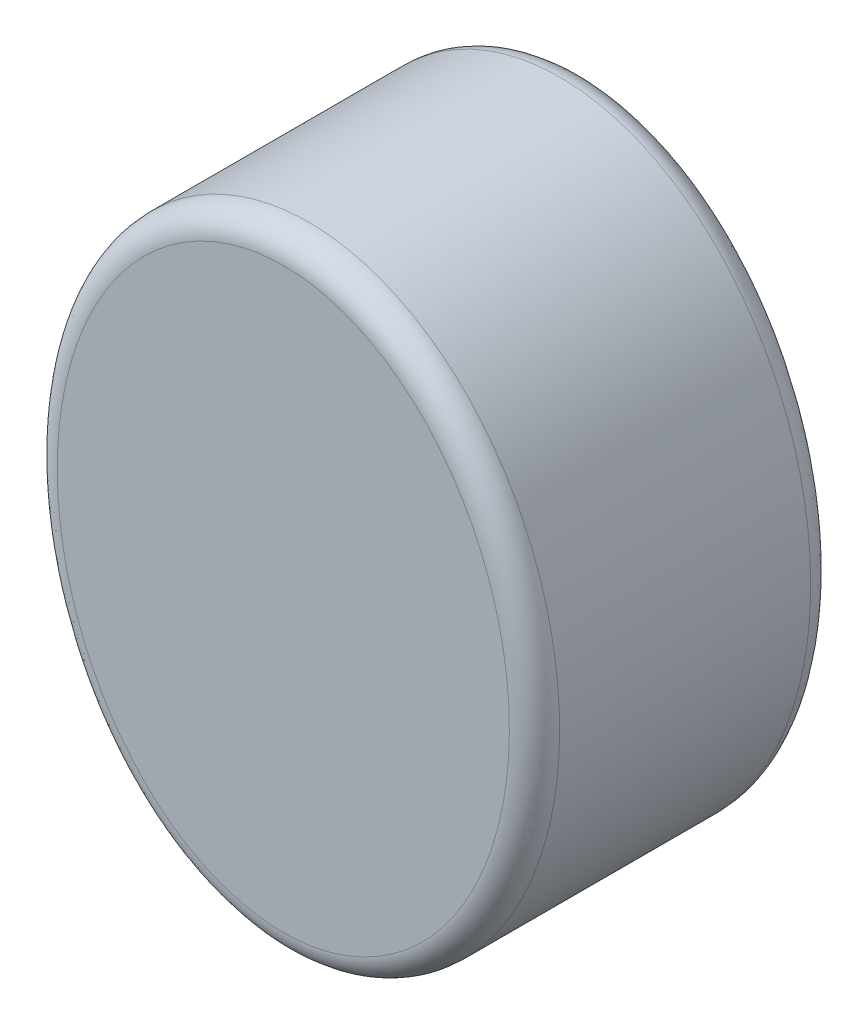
ISO-10303-21;
HEADER;
FILE_DESCRIPTION(('STEP AP214'),'2;1');
FILE_NAME('part.step','',(''),(''),'','','');
FILE_SCHEMA(('AUTOMOTIVE_DESIGN { 1 0 10303 214 1 1 1 1 }'));
ENDSEC;
DATA;
#1=APPLICATION_CONTEXT('core data for automotive mechanical design processes');
#2=APPLICATION_PROTOCOL_DEFINITION('international standard','automotive_design',2000,#1);
#3=PRODUCT_CONTEXT('',#1,'mechanical');
#4=PRODUCT('Part','Part','',(#3));
#5=PRODUCT_RELATED_PRODUCT_CATEGORY('part','',(#4));
#6=PRODUCT_DEFINITION_FORMATION('','',#4);
#7=PRODUCT_DEFINITION_CONTEXT('part definition',#1,'design');
#8=PRODUCT_DEFINITION('design','',#6,#7);
#9=PRODUCT_DEFINITION_SHAPE('','',#8);
#10=(LENGTH_UNIT() NAMED_UNIT(*) SI_UNIT(.MILLI.,.METRE.));
#11=(NAMED_UNIT(*) PLANE_ANGLE_UNIT() SI_UNIT($,.RADIAN.));
#12=(NAMED_UNIT(*) SI_UNIT($,.STERADIAN.) SOLID_ANGLE_UNIT());
#13=UNCERTAINTY_MEASURE_WITH_UNIT(LENGTH_MEASURE(1.E-05),#10,'distance_accuracy_value','');
#14=(GEOMETRIC_REPRESENTATION_CONTEXT(3) GLOBAL_UNCERTAINTY_ASSIGNED_CONTEXT((#13)) GLOBAL_UNIT_ASSIGNED_CONTEXT((#10,
#11,#12)) REPRESENTATION_CONTEXT('',''));
#15=CARTESIAN_POINT('',(0.,0.,0.));
#16=DIRECTION('',(0.,0.,1.));
#17=DIRECTION('',(1.,0.,0.));
#18=AXIS2_PLACEMENT_3D('',#15,#16,#17);
#19=CARTESIAN_POINT('',(0.,0.,12.));
#20=DIRECTION('',(0.,0.,1.));
#21=DIRECTION('',(0.,-1.,0.));
#22=AXIS2_PLACEMENT_3D('',#19,#20,#21);
#23=ELLIPSE('',#22,12.5,10.);
#24=DIRECTION('',(0.,0.,-1.));
#25=VECTOR('',#24,1.);
#26=SURFACE_OF_LINEAR_EXTRUSION('',#23,#25);
#27=CARTESIAN_POINT('',(-1.91382941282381,-11.2354288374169,0.));
#28=CARTESIAN_POINT('',(-2.18313530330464,-12.1984835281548,0.));
#29=CARTESIAN_POINT('',(-2.18313530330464,-12.1984835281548,1.));
#30=CARTESIAN_POINT('',(-1.7024161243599,-11.2945486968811,0.));
#31=CARTESIAN_POINT('',(-1.94285591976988,-12.2656752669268,0.));
#32=CARTESIAN_POINT('',(-1.94285591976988,-12.2656752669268,1.));
#33=CARTESIAN_POINT('',(-1.4883367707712,-11.344150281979,0.));
#34=CARTESIAN_POINT('',(-1.69911747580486,-12.3221669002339,0.));
#35=CARTESIAN_POINT('',(-1.69911747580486,-12.3221669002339,1.));
#36=CARTESIAN_POINT('',(-1.05650218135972,-11.4234204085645,0.));
#37=CARTESIAN_POINT('',(-1.20682674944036,-12.4125344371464,0.));
#38=CARTESIAN_POINT('',(-1.20682674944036,-12.4125344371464,1.));
#39=CARTESIAN_POINT('',(-0.838746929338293,-11.453088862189,0.));
#40=CARTESIAN_POINT('',(-0.958274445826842,-12.4464102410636,0.));
#41=CARTESIAN_POINT('',(-0.958274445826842,-12.4464102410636,1.));
#42=CARTESIAN_POINT('',(-0.40147392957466,-11.4919136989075,0.));
#43=CARTESIAN_POINT('',(-0.458835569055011,-12.4907545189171,0.));
#44=CARTESIAN_POINT('',(-0.458835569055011,-12.4907545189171,1.));
#45=CARTESIAN_POINT('',(-0.181956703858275,-11.5010759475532,0.));
#46=CARTESIAN_POINT('',(-0.207949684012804,-12.5012296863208,0.));
#47=CARTESIAN_POINT('',(-0.207949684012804,-12.5012296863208,1.));
#48=CARTESIAN_POINT('',(0.256957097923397,-11.4987231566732,0.));
#49=CARTESIAN_POINT('',(0.293664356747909,-12.4985407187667,0.));
#50=CARTESIAN_POINT('',(0.293664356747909,-12.4985407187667,1.));
#51=CARTESIAN_POINT('',(0.476353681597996,-11.4872096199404,0.));
#52=CARTESIAN_POINT('',(0.544392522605,-12.4853783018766,0.));
#53=CARTESIAN_POINT('',(0.544392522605,-12.4853783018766,1.));
#54=CARTESIAN_POINT('',(0.892706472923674,-11.4457705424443,0.));
#55=CARTESIAN_POINT('',(1.019864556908,-12.4380556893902,0.));
#56=CARTESIAN_POINT('',(1.019864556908,-12.4380556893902,1.));
#57=CARTESIAN_POINT('',(1.08984647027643,-11.4176631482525,0.));
#58=CARTESIAN_POINT('',(1.24485011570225,-12.4059692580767,0.));
#59=CARTESIAN_POINT('',(1.24485011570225,-12.4059692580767,1.));
#60=CARTESIAN_POINT('',(1.48115240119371,-11.3450802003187,0.));
#61=CARTESIAN_POINT('',(1.69091562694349,-12.3232290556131,0.));
#62=CARTESIAN_POINT('',(1.69091562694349,-12.3232290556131,1.));
#63=CARTESIAN_POINT('',(1.67531731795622,-11.3005991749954,0.));
#64=CARTESIAN_POINT('',(1.91199424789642,-12.2725690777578,0.));
#65=CARTESIAN_POINT('',(1.91199424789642,-12.2725690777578,1.));
#66=CARTESIAN_POINT('',(2.059297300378,-11.1959466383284,0.));
#67=CARTESIAN_POINT('',(2.34851419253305,-12.1535973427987,0.));
#68=CARTESIAN_POINT('',(2.34851419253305,-12.1535973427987,1.));
#69=CARTESIAN_POINT('',(2.24911382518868,-11.1357804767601,0.));
#70=CARTESIAN_POINT('',(2.56395741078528,-12.085291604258,0.));
#71=CARTESIAN_POINT('',(2.56395741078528,-12.085291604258,1.));
#72=CARTESIAN_POINT('',(2.62340980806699,-11.0005981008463,0.));
#73=CARTESIAN_POINT('',(2.98799061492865,-11.9321458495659,0.));
#74=CARTESIAN_POINT('',(2.98799061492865,-11.9321458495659,1.));
#75=CARTESIAN_POINT('',(2.80788717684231,-10.9255761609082,0.));
#76=CARTESIAN_POINT('',(3.19657792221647,-11.8472994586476,0.));
#77=CARTESIAN_POINT('',(3.19657792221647,-11.8472994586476,1.));
#78=CARTESIAN_POINT('',(3.36323170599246,-10.674465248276,0.));
#79=CARTESIAN_POINT('',(3.82317134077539,-11.5639728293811,0.));
#80=CARTESIAN_POINT('',(3.82317134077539,-11.5639728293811,1.));
#81=CARTESIAN_POINT('',(3.72405521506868,-10.4756356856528,0.));
#82=CARTESIAN_POINT('',(4.22840825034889,-11.3404835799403,0.));
#83=CARTESIAN_POINT('',(4.22840825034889,-11.3404835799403,1.));
#84=CARTESIAN_POINT('',(4.41282243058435,-10.0280273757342,0.));
#85=CARTESIAN_POINT('',(4.99842245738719,-10.8400820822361,0.));
#86=CARTESIAN_POINT('',(4.99842245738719,-10.8400820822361,1.));
#87=CARTESIAN_POINT('',(4.74075305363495,-9.77922887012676,0.));
#88=CARTESIAN_POINT('',(5.36318366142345,-10.5631487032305,0.));
#89=CARTESIAN_POINT('',(5.36318366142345,-10.5631487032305,1.));
#90=CARTESIAN_POINT('',(5.40833920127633,-9.19930690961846,0.));
#91=CARTESIAN_POINT('',(6.10258644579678,-9.92084572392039,0.));
#92=CARTESIAN_POINT('',(6.10258644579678,-9.92084572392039,1.));
#93=CARTESIAN_POINT('',(5.74210287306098,-8.86141121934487,0.));
#94=CARTESIAN_POINT('',(6.47019042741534,-9.54842773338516,0.));
#95=CARTESIAN_POINT('',(6.47019042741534,-9.54842773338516,1.));
#96=CARTESIAN_POINT('',(6.36013493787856,-8.14321329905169,0.));
#97=CARTESIAN_POINT('',(7.14808167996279,-8.76066603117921,0.));
#98=CARTESIAN_POINT('',(7.14808167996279,-8.76066603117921,1.));
#99=CARTESIAN_POINT('',(6.64437181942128,-7.76288432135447,0.));
#100=CARTESIAN_POINT('',(7.45833246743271,-8.34529525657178,0.));
#101=CARTESIAN_POINT('',(7.45833246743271,-8.34529525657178,1.));
#102=CARTESIAN_POINT('',(7.21857832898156,-6.88531158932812,0.));
#103=CARTESIAN_POINT('',(8.08305336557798,-7.39052831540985,0.));
#104=CARTESIAN_POINT('',(8.08305336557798,-7.39052831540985,1.));
#105=CARTESIAN_POINT('',(7.49686182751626,-6.380424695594,0.));
#106=CARTESIAN_POINT('',(8.38433348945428,-6.84356505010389,0.));
#107=CARTESIAN_POINT('',(8.38433348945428,-6.84356505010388,1.));
#108=CARTESIAN_POINT('',(7.9817682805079,-5.33747779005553,0.));
#109=CARTESIAN_POINT('',(8.90789259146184,-5.71746829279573,0.));
#110=CARTESIAN_POINT('',(8.90789259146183,-5.71746829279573,1.));
#111=CARTESIAN_POINT('',(8.18834511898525,-4.79939669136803,0.));
#112=CARTESIAN_POINT('',(9.13012073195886,-5.13831437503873,0.));
#113=CARTESIAN_POINT('',(9.13012073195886,-5.13831437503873,1.));
#114=CARTESIAN_POINT('',(8.56813337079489,-3.58419545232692,0.));
#115=CARTESIAN_POINT('',(9.53800222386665,-3.83323972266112,0.));
#116=CARTESIAN_POINT('',(9.53800222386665,-3.83323972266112,1.));
#117=CARTESIAN_POINT('',(8.72483777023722,-2.90189301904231,0.));
#118=CARTESIAN_POINT('',(9.70575260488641,-3.1023563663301,0.));
#119=CARTESIAN_POINT('',(9.7057526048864,-3.1023563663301,1.));
#120=CARTESIAN_POINT('',(8.93756852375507,-1.52153793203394,0.));
#121=CARTESIAN_POINT('',(9.9333287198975,-1.62563297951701,0.));
#122=CARTESIAN_POINT('',(9.93332871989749,-1.62563297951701,1.));
#123=CARTESIAN_POINT('',(8.9935029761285,-0.82347148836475,0.));
#124=CARTESIAN_POINT('',(9.99305593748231,-0.879779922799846,0.));
#125=CARTESIAN_POINT('',(9.99305593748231,-0.879779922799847,1.));
#126=CARTESIAN_POINT('',(9.00629349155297,0.674780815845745,0.));
#127=CARTESIAN_POINT('',(10.0067270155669,0.720922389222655,0.));
#128=CARTESIAN_POINT('',(10.0067270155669,0.720922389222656,1.));
#129=CARTESIAN_POINT('',(8.94766012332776,1.47514308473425,0.));
#130=CARTESIAN_POINT('',(9.94413306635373,1.57594366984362,0.));
#131=CARTESIAN_POINT('',(9.94413306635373,1.57594366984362,1.));
#132=CARTESIAN_POINT('',(8.69806077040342,3.05523768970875,0.));
#133=CARTESIAN_POINT('',(9.67709742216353,3.26646569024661,0.));
#134=CARTESIAN_POINT('',(9.67709742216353,3.26646569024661,1.));
#135=CARTESIAN_POINT('',(8.50712483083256,3.83497466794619,0.));
#136=CARTESIAN_POINT('',(9.4726879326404,4.10197081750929,0.));
#137=CARTESIAN_POINT('',(9.4726879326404,4.10197081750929,1.));
#138=CARTESIAN_POINT('',(8.03474443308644,5.21571462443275,0.));
#139=CARTESIAN_POINT('',(8.9648869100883,5.58622319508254,0.));
#140=CARTESIAN_POINT('',(8.9648869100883,5.58622319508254,1.));
#141=CARTESIAN_POINT('',(7.77495753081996,5.82413385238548,0.));
#142=CARTESIAN_POINT('',(8.68504600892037,6.24208508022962,0.));
#143=CARTESIAN_POINT('',(8.68504600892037,6.24208508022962,1.));
#144=CARTESIAN_POINT('',(7.1602868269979,6.9909793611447,0.));
#145=CARTESIAN_POINT('',(8.01976630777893,7.50503093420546,0.));
#146=CARTESIAN_POINT('',(8.01976630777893,7.50503093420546,1.));
#147=CARTESIAN_POINT('',(6.80552904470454,7.54947059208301,0.));
#148=CARTESIAN_POINT('',(7.63446742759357,8.11217816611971,0.));
#149=CARTESIAN_POINT('',(7.63446742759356,8.11217816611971,1.));
#150=CARTESIAN_POINT('',(6.08490415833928,8.48247948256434,0.));
#151=CARTESIAN_POINT('',(6.84671379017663,9.13208099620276,0.));
#152=CARTESIAN_POINT('',(6.84671379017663,9.13208099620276,1.));
#153=CARTESIAN_POINT('',(5.73714435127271,8.87096091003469,0.));
#154=CARTESIAN_POINT('',(6.4649982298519,9.5588343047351,0.));
#155=CARTESIAN_POINT('',(6.4649982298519,9.55883430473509,1.));
#156=CARTESIAN_POINT('',(4.98324528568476,9.58668208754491,0.));
#157=CARTESIAN_POINT('',(5.63249664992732,10.3491814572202,0.));
#158=CARTESIAN_POINT('',(5.63249664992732,10.3491814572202,1.));
#159=CARTESIAN_POINT('',(4.57716325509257,9.91398115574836,0.));
#160=CARTESIAN_POINT('',(5.18177831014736,10.7128364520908,0.));
#161=CARTESIAN_POINT('',(5.18177831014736,10.7128364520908,1.));
#162=CARTESIAN_POINT('',(3.78338925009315,10.4420417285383,0.));
#163=CARTESIAN_POINT('',(4.29499348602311,11.3027536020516,0.));
#164=CARTESIAN_POINT('',(4.29499348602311,11.3027536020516,1.));
#165=CARTESIAN_POINT('',(3.40374341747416,10.6547751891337,0.));
#166=CARTESIAN_POINT('',(3.86880914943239,11.5417887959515,0.));
#167=CARTESIAN_POINT('',(3.86880914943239,11.5417887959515,1.));
#168=CARTESIAN_POINT('',(2.81222558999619,10.9242506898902,0.));
#169=CARTESIAN_POINT('',(3.20150646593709,11.8457888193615,0.));
#170=CARTESIAN_POINT('',(3.20150646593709,11.8457888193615,1.));
#171=CARTESIAN_POINT('',(2.61143894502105,11.0057887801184,0.));
#172=CARTESIAN_POINT('',(2.97447041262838,11.938011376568,0.));
#173=CARTESIAN_POINT('',(2.97447041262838,11.938011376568,1.));
#174=CARTESIAN_POINT('',(2.20359501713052,11.1512227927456,0.));
#175=CARTESIAN_POINT('',(2.51234257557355,12.1028029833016,0.));
#176=CARTESIAN_POINT('',(2.51234257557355,12.1028029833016,1.));
#177=CARTESIAN_POINT('',(1.9965392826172,11.2151230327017,0.));
#178=CARTESIAN_POINT('',(2.27725277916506,12.1753768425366,0.));
#179=CARTESIAN_POINT('',(2.27725277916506,12.1753768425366,1.));
#180=CARTESIAN_POINT('',(1.49566559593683,11.3455080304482,0.));
#181=CARTESIAN_POINT('',(1.70759681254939,12.3236642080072,0.));
#182=CARTESIAN_POINT('',(1.70759681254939,12.3236642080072,1.));
#183=CARTESIAN_POINT('',(1.19952644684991,11.4032670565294,0.));
#184=CARTESIAN_POINT('',(1.37001770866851,12.3895473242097,0.));
#185=CARTESIAN_POINT('',(1.37001770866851,12.3895473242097,1.));
#186=CARTESIAN_POINT('',(0.602223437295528,11.4805095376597,0.));
#187=CARTESIAN_POINT('',(0.688253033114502,12.477710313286,0.));
#188=CARTESIAN_POINT('',(0.688253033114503,12.477710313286,1.));
#189=CARTESIAN_POINT('',(0.301059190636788,11.4999900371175,0.));
#190=CARTESIAN_POINT('',(0.34406695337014,12.4999868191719,0.));
#191=CARTESIAN_POINT('',(0.344066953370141,12.4999868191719,1.));
#192=CARTESIAN_POINT('',(-0.206790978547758,11.5000068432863,0.));
#193=CARTESIAN_POINT('',(-0.236332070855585,12.5000090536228,0.));
#194=CARTESIAN_POINT('',(-0.236332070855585,12.5000090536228,1.));
#195=CARTESIAN_POINT('',(-0.413532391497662,11.4908274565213,0.));
#196=CARTESIAN_POINT('',(-0.472607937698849,12.4895142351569,0.));
#197=CARTESIAN_POINT('',(-0.472607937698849,12.4895142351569,1.));
#198=CARTESIAN_POINT('',(-0.825465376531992,11.4542836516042,0.));
#199=CARTESIAN_POINT('',(-0.943105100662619,12.4477745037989,0.));
#200=CARTESIAN_POINT('',(-0.943105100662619,12.4477745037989,1.));
#201=CARTESIAN_POINT('',(-1.03065662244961,11.4269155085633,0.));
#202=CARTESIAN_POINT('',(-1.17732596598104,12.4165253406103,0.));
#203=CARTESIAN_POINT('',(-1.17732596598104,12.4165253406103,1.));
#204=CARTESIAN_POINT('',(-1.43799025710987,11.3544283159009,0.));
#205=CARTESIAN_POINT('',(-1.6417530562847,12.3338784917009,0.));
#206=CARTESIAN_POINT('',(-1.6417530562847,12.3338784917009,1.));
#207=CARTESIAN_POINT('',(-1.64013073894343,11.3092986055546,0.));
#208=CARTESIAN_POINT('',(-1.87195678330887,12.2824687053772,0.));
#209=CARTESIAN_POINT('',(-1.87195678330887,12.2824687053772,1.));
#210=CARTESIAN_POINT('',(-2.03991235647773,11.2020066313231,0.));
#211=CARTESIAN_POINT('',(-2.32650843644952,12.1604779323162,0.));
#212=CARTESIAN_POINT('',(-2.32650843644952,12.1604779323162,1.));
#213=CARTESIAN_POINT('',(-2.23755165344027,11.1398375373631,0.));
#214=CARTESIAN_POINT('',(-2.55085397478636,12.0898892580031,0.));
#215=CARTESIAN_POINT('',(-2.55085397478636,12.0898892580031,1.));
#216=CARTESIAN_POINT('',(-2.62603120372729,10.9997672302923,0.));
#217=CARTESIAN_POINT('',(-2.99096510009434,11.9312031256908,0.));
#218=CARTESIAN_POINT('',(-2.99096510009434,11.9312031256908,1.));
#219=CARTESIAN_POINT('',(-2.81690089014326,10.9219475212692,0.));
#220=CARTESIAN_POINT('',(-3.20676847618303,11.8431964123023,0.));
#221=CARTESIAN_POINT('',(-3.20676847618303,11.8431964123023,1.));
#222=CARTESIAN_POINT('',(-3.19191216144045,10.7514469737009,0.));
#223=CARTESIAN_POINT('',(-3.62985012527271,11.6508402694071,0.));
#224=CARTESIAN_POINT('',(-3.62985012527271,11.6508402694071,1.));
#225=CARTESIAN_POINT('',(-3.37605124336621,10.6587606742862,0.));
#226=CARTESIAN_POINT('',(-3.83712523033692,11.5464848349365,0.));
#227=CARTESIAN_POINT('',(-3.83712523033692,11.5464848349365,1.));
#228=CARTESIAN_POINT('',(-3.91692287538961,10.3601694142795,0.));
#229=CARTESIAN_POINT('',(-4.44454733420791,11.2111559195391,0.));
#230=CARTESIAN_POINT('',(-4.44454733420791,11.2111559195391,1.));
#231=CARTESIAN_POINT('',(-4.26244107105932,10.1336100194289,0.));
#232=CARTESIAN_POINT('',(-4.83066638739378,10.9577809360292,0.));
#233=CARTESIAN_POINT('',(-4.83066638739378,10.9577809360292,1.));
#234=CARTESIAN_POINT('',(-4.95229091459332,9.60930289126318,0.));
#235=CARTESIAN_POINT('',(-5.59812879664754,10.3744952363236,0.));
#236=CARTESIAN_POINT('',(-5.59812879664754,10.3744952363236,1.));
#237=CARTESIAN_POINT('',(-5.29283182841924,9.30662533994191,0.));
#238=CARTESIAN_POINT('',(-5.97488051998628,10.039388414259,0.));
#239=CARTESIAN_POINT('',(-5.97488051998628,10.039388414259,1.));
#240=CARTESIAN_POINT('',(-5.92898848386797,8.65727534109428,0.));
#241=CARTESIAN_POINT('',(-6.67564131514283,9.32408790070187,0.));
#242=CARTESIAN_POINT('',(-6.67564131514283,9.32408790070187,1.));
#243=CARTESIAN_POINT('',(-6.22456783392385,8.31056766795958,0.));
#244=CARTESIAN_POINT('',(-6.99960767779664,8.94385812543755,0.));
#245=CARTESIAN_POINT('',(-6.99960767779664,8.94385812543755,1.));
#246=CARTESIAN_POINT('',(-6.9004085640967,7.40887160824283,0.));
#247=CARTESIAN_POINT('',(-7.73774092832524,7.95907979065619,0.));
#248=CARTESIAN_POINT('',(-7.73774092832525,7.9590797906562,1.));
#249=CARTESIAN_POINT('',(-7.25364137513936,6.83352441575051,0.));
#250=CARTESIAN_POINT('',(-8.12103423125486,7.33416318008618,0.));
#251=CARTESIAN_POINT('',(-8.12103423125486,7.33416318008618,1.));
#252=CARTESIAN_POINT('',(-7.86163968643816,5.63298220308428,0.));
#253=CARTESIAN_POINT('',(-8.77856044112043,6.03579510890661,0.));
#254=CARTESIAN_POINT('',(-8.77856044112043,6.03579510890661,1.));
#255=CARTESIAN_POINT('',(-8.11625777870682,5.00771423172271,0.));
#256=CARTESIAN_POINT('',(-9.05263009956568,5.36227276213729,0.));
#257=CARTESIAN_POINT('',(-9.05263009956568,5.36227276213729,1.));
#258=CARTESIAN_POINT('',(-8.53199165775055,3.71869161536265,0.));
#259=CARTESIAN_POINT('',(-9.49924733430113,3.97748511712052,0.));
#260=CARTESIAN_POINT('',(-9.49924733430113,3.97748511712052,1.));
#261=CARTESIAN_POINT('',(-8.69193455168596,3.05456183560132,0.));
#262=CARTESIAN_POINT('',(-9.67052176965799,3.26586082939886,0.));
#263=CARTESIAN_POINT('',(-9.67052176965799,3.26586082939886,1.));
#264=CARTESIAN_POINT('',(-8.91570799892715,1.71056185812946,0.));
#265=CARTESIAN_POINT('',(-9.90996620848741,1.82771517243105,0.));
#266=CARTESIAN_POINT('',(-9.90996620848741,1.82771517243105,1.));
#267=CARTESIAN_POINT('',(-8.97953269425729,1.03069070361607,0.));
#268=CARTESIAN_POINT('',(-9.9781299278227,1.10119289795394,0.));
#269=CARTESIAN_POINT('',(-9.97812992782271,1.10119289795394,1.));
#270=CARTESIAN_POINT('',(-9.01487220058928,-0.447058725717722,0.));
#271=CARTESIAN_POINT('',(-10.0158927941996,-0.477650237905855,0.));
#272=CARTESIAN_POINT('',(-10.0158927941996,-0.477650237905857,1.));
#273=CARTESIAN_POINT('',(-8.96890546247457,-1.24540503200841,0.));
#274=CARTESIAN_POINT('',(-9.96682547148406,-1.33041939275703,0.));
#275=CARTESIAN_POINT('',(-9.96682547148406,-1.33041939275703,1.));
#276=CARTESIAN_POINT('',(-8.74578239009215,-2.82404444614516,0.));
#277=CARTESIAN_POINT('',(-9.728181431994,-3.01891659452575,0.));
#278=CARTESIAN_POINT('',(-9.728181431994,-3.01891659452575,1.));
#279=CARTESIAN_POINT('',(-8.56860918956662,-3.60433521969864,0.));
#280=CARTESIAN_POINT('',(-9.53858665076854,-3.85464243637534,0.));
#281=CARTESIAN_POINT('',(-9.53858665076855,-3.85464243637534,1.));
#282=CARTESIAN_POINT('',(-8.11918351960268,-4.99932697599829,0.));
#283=CARTESIAN_POINT('',(-9.05577184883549,-5.35325439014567,0.));
#284=CARTESIAN_POINT('',(-9.05577184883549,-5.35325439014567,1.));
#285=CARTESIAN_POINT('',(-7.86685426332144,-5.62044906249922,0.));
#286=CARTESIAN_POINT('',(-8.78417481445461,-6.02229031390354,0.));
#287=CARTESIAN_POINT('',(-8.7841748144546,-6.02229031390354,1.));
#288=CARTESIAN_POINT('',(-7.26481219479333,-6.81363695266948,0.));
#289=CARTESIAN_POINT('',(-8.13313945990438,-7.31260747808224,0.));
#290=CARTESIAN_POINT('',(-8.13313945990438,-7.31260747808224,1.));
#291=CARTESIAN_POINT('',(-6.91522911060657,-7.38576678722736,0.));
#292=CARTESIAN_POINT('',(-7.75384478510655,-7.9339509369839,0.));
#293=CARTESIAN_POINT('',(-7.75384478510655,-7.9339509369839,1.));
#294=CARTESIAN_POINT('',(-6.20200696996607,-8.34315536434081,0.));
#295=CARTESIAN_POINT('',(-6.97502853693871,-8.97936981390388,0.));
#296=CARTESIAN_POINT('',(-6.97502853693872,-8.97936981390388,1.));
#297=CARTESIAN_POINT('',(-5.85705811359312,-8.74231743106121,0.));
#298=CARTESIAN_POINT('',(-6.5968406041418,-9.41734093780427,0.));
#299=CARTESIAN_POINT('',(-6.5968406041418,-9.41734093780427,1.));
#300=CARTESIAN_POINT('',(-5.10714609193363,-9.47971367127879,0.));
#301=CARTESIAN_POINT('',(-5.76972574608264,-10.2306566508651,0.));
#302=CARTESIAN_POINT('',(-5.76972574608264,-10.2306566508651,1.));
#303=CARTESIAN_POINT('',(-4.70225399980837,-9.81801896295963,0.));
#304=CARTESIAN_POINT('',(-5.32088255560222,-10.6060743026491,0.));
#305=CARTESIAN_POINT('',(-5.32088255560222,-10.6060743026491,1.));
#306=CARTESIAN_POINT('',(-3.9103966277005,-10.3651870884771,0.));
#307=CARTESIAN_POINT('',(-4.43726578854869,-11.2166281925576,0.));
#308=CARTESIAN_POINT('',(-4.43726578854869,-11.2166281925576,1.));
#309=CARTESIAN_POINT('',(-3.53195639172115,-10.5862621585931,0.));
#310=CARTESIAN_POINT('',(-4.01292292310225,-11.4647486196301,0.));
#311=CARTESIAN_POINT('',(-4.01292292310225,-11.4647486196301,1.));
#312=CARTESIAN_POINT('',(-2.94101047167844,-10.8685201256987,0.));
#313=CARTESIAN_POINT('',(-3.34694662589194,-11.7828432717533,0.));
#314=CARTESIAN_POINT('',(-3.34694662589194,-11.7828432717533,1.));
#315=CARTESIAN_POINT('',(-2.74008386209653,-10.9543986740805,0.));
#316=CARTESIAN_POINT('',(-3.11997175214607,-11.8798814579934,0.));
#317=CARTESIAN_POINT('',(-3.11997175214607,-11.8798814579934,1.));
#318=CARTESIAN_POINT('',(-2.33159125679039,-11.1084592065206,0.));
#319=CARTESIAN_POINT('',(-2.65751374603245,-12.0542945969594,0.));
#320=CARTESIAN_POINT('',(-2.65751374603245,-12.0542945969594,1.));
#321=CARTESIAN_POINT('',(-2.12402809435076,-11.1766486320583,0.));
#322=CARTESIAN_POINT('',(-2.42203423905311,-12.1316778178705,0.));
#323=CARTESIAN_POINT('',(-2.42203423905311,-12.1316778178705,1.));
#324=CARTESIAN_POINT('',(-1.91382941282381,-11.2354288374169,0.));
#325=CARTESIAN_POINT('',(-2.18313530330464,-12.1984835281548,0.));
#326=CARTESIAN_POINT('',(-2.18313530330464,-12.1984835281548,1.));
#327=(BOUNDED_SURFACE() B_SPLINE_SURFACE(3,2,((#27,#28,#29),(#30,#31,#32),(#33,#34,#35),(#36,
#37,#38),(#39,#40,#41),(#42,#43,#44),(#45,#46,#47),(#48,#49,#50),(#51,#52,#53),(#54,#55,#56),
(#57,#58,#59),(#60,#61,#62),(#63,#64,#65),(#66,#67,#68),(#69,#70,#71),(#72,#73,#74),(#75,#76,
#77),(#78,#79,#80),(#81,#82,#83),(#84,#85,#86),(#87,#88,#89),(#90,#91,#92),(#93,#94,#95),(#96,
#97,#98),(#99,#100,#101),(#102,#103,#104),(#105,#106,#107),(#108,#109,#110),(#111,#112,#113),
(#114,#115,#116),(#117,#118,#119),(#120,#121,#122),(#123,#124,#125),(#126,#127,#128),(#129,#130,
#131),(#132,#133,#134),(#135,#136,#137),(#138,#139,#140),(#141,#142,#143),(#144,#145,#146),
(#147,#148,#149),(#150,#151,#152),(#153,#154,#155),(#156,#157,#158),(#159,#160,#161),(#162,#163,
#164),(#165,#166,#167),(#168,#169,#170),(#171,#172,#173),(#174,#175,#176),(#177,#178,#179),
(#180,#181,#182),(#183,#184,#185),(#186,#187,#188),(#189,#190,#191),(#192,#193,#194),(#195,#196,
#197),(#198,#199,#200),(#201,#202,#203),(#204,#205,#206),(#207,#208,#209),(#210,#211,#212),
(#213,#214,#215),(#216,#217,#218),(#219,#220,#221),(#222,#223,#224),(#225,#226,#227),(#228,#229,
#230),(#231,#232,#233),(#234,#235,#236),(#237,#238,#239),(#240,#241,#242),(#243,#244,#245),
(#246,#247,#248),(#249,#250,#251),(#252,#253,#254),(#255,#256,#257),(#258,#259,#260),(#261,#262,
#263),(#264,#265,#266),(#267,#268,#269),(#270,#271,#272),(#273,#274,#275),(#276,#277,#278),
(#279,#280,#281),(#282,#283,#284),(#285,#286,#287),(#288,#289,#290),(#291,#292,#293),(#294,#295,
#296),(#297,#298,#299),(#300,#301,#302),(#303,#304,#305),(#306,#307,#308),(#309,#310,#311),
(#312,#313,#314),(#315,#316,#317),(#318,#319,#320),(#321,#322,#323),(#324,#325,#326)),
.UNSPECIFIED.,.T.,.F.,.F.) B_SPLINE_SURFACE_WITH_KNOTS((4,2,2,2,2,2,2,2,2,2,2,2,2,2,2,2,2,2,2,2,
2,2,2,2,2,2,2,2,2,2,2,2,2,2,2,2,2,2,2,2,2,2,2,2,2,2,2,2,2,4),(3,3),(0.,0.658343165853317,
1.31668923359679,1.97484696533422,2.63295686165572,3.2296624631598,3.82656764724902,
4.42326950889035,5.02020179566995,6.25086665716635,7.48201909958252,8.90166610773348,
10.3222130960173,12.0454801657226,13.7698534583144,15.861915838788,17.9558852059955,
20.352518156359,22.7486070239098,24.725819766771,26.70042178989,28.2587628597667,
29.8155851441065,31.1151964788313,31.764629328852,32.4139030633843,33.3165922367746,
34.2193511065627,34.8394364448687,35.459648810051,36.0802340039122,36.7010683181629,
37.318749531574,37.9366581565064,39.1714277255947,40.5334283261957,41.8965255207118,
43.9109863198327,45.9284467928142,47.9704042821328,50.0124862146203,52.4007247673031,
54.789270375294,56.792899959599,58.7938695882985,60.3706500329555,61.9455756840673,
63.2544640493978,63.9093008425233,64.5638617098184),(0.,1.),
.UNSPECIFIED.) GEOMETRIC_REPRESENTATION_ITEM() RATIONAL_B_SPLINE_SURFACE(((1.,0.707106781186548,
1.),(1.,0.707106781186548,1.),(1.,0.707106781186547,1.),(1.,0.707106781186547,1.),(1.,
0.707106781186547,1.),(1.,0.707106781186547,1.),(1.,0.707106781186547,1.),(1.,0.707106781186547,
1.),(1.,0.707106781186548,1.),(1.,0.707106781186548,1.),(1.,0.707106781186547,1.),(1.,
0.707106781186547,1.),(1.,0.707106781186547,1.),(1.,0.707106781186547,1.),(1.,0.707106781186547,
1.),(1.,0.707106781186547,1.),(1.,0.707106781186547,1.),(1.,0.707106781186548,1.),(1.,
0.707106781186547,1.),(1.,0.707106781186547,1.),(1.,0.707106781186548,1.),(1.,0.707106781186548,
1.),(1.,0.707106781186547,1.),(1.,0.707106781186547,1.),(1.,0.707106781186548,1.),(1.,
0.707106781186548,1.),(1.,0.707106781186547,1.),(1.,0.707106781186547,1.),(1.,0.707106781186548,
1.),(1.,0.707106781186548,1.),(1.,0.707106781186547,1.),(1.,0.707106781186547,1.),(1.,
0.707106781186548,1.),(1.,0.707106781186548,1.),(1.,0.707106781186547,1.),(1.,0.707106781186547,
1.),(1.,0.707106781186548,1.),(1.,0.707106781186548,1.),(1.,0.707106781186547,1.),(1.,
0.707106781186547,1.),(1.,0.707106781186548,1.),(1.,0.707106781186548,1.),(1.,0.707106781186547,
1.),(1.,0.707106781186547,1.),(1.,0.707106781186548,1.),(1.,0.707106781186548,1.),(1.,
0.707106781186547,1.),(1.,0.707106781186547,1.),(1.,0.707106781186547,1.),(1.,0.707106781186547,
1.),(1.,0.707106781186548,1.),(1.,0.707106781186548,1.),(1.,0.707106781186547,1.),(1.,
0.707106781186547,1.),(1.,0.707106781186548,1.),(1.,0.707106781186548,1.),(1.,0.707106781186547,
1.),(1.,0.707106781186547,1.),(1.,0.707106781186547,1.),(1.,0.707106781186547,1.),(1.,
0.707106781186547,1.),(1.,0.707106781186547,1.),(1.,0.707106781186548,1.),(1.,0.707106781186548,
1.),(1.,0.707106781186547,1.),(1.,0.707106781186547,1.),(1.,0.707106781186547,1.),(1.,
0.707106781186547,1.),(1.,0.707106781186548,1.),(1.,0.707106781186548,1.),(1.,0.707106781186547,
1.),(1.,0.707106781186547,1.),(1.,0.707106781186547,1.),(1.,0.707106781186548,1.),(1.,
0.707106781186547,1.),(1.,0.707106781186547,1.),(1.,0.707106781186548,1.),(1.,0.707106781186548,
1.),(1.,0.707106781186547,1.),(1.,0.707106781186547,1.),(1.,0.707106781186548,1.),(1.,
0.707106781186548,1.),(1.,0.707106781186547,1.),(1.,0.707106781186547,1.),(1.,0.707106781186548,
1.),(1.,0.707106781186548,1.),(1.,0.707106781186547,1.),(1.,0.707106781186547,1.),(1.,
0.707106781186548,1.),(1.,0.707106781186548,1.),(1.,0.707106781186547,1.),(1.,0.707106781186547,
1.),(1.,0.707106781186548,1.),(1.,0.707106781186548,1.),(1.,0.707106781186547,1.),(1.,
0.707106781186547,1.),(1.,0.707106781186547,1.),(1.,0.707106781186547,1.),(1.,0.707106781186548,
1.),(1.,0.707106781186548,1.))) REPRESENTATION_ITEM('') SURFACE());
#328=CARTESIAN_POINT('',(-2.18313530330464,-12.1984835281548,1.));
#329=CARTESIAN_POINT('',(-1.94285591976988,-12.2656752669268,1.));
#330=CARTESIAN_POINT('',(-1.69911747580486,-12.3221669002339,1.));
#331=CARTESIAN_POINT('',(-1.20682674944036,-12.4125344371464,1.));
#332=CARTESIAN_POINT('',(-0.958274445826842,-12.4464102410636,1.));
#333=CARTESIAN_POINT('',(-0.458835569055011,-12.4907545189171,1.));
#334=CARTESIAN_POINT('',(-0.207949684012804,-12.5012296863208,1.));
#335=CARTESIAN_POINT('',(0.293664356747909,-12.4985407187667,1.));
#336=CARTESIAN_POINT('',(0.544392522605,-12.4853783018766,1.));
#337=CARTESIAN_POINT('',(1.019864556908,-12.4380556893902,1.));
#338=CARTESIAN_POINT('',(1.24485011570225,-12.4059692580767,1.));
#339=CARTESIAN_POINT('',(1.69091562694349,-12.3232290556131,1.));
#340=CARTESIAN_POINT('',(1.91199424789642,-12.2725690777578,1.));
#341=CARTESIAN_POINT('',(2.34851419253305,-12.1535973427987,1.));
#342=CARTESIAN_POINT('',(2.56395741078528,-12.085291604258,1.));
#343=CARTESIAN_POINT('',(2.98799061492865,-11.9321458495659,1.));
#344=CARTESIAN_POINT('',(3.19657792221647,-11.8472994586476,1.));
#345=CARTESIAN_POINT('',(3.82317134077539,-11.5639728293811,1.));
#346=CARTESIAN_POINT('',(4.22840825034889,-11.3404835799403,1.));
#347=CARTESIAN_POINT('',(4.99842245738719,-10.8400820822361,1.));
#348=CARTESIAN_POINT('',(5.36318366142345,-10.5631487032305,1.));
#349=CARTESIAN_POINT('',(6.10258644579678,-9.9208457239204,1.));
#350=CARTESIAN_POINT('',(6.47019042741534,-9.54842773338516,1.));
#351=CARTESIAN_POINT('',(7.14808167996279,-8.76066603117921,1.));
#352=CARTESIAN_POINT('',(7.45833246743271,-8.34529525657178,1.));
#353=CARTESIAN_POINT('',(8.08305336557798,-7.39052831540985,1.));
#354=CARTESIAN_POINT('',(8.38433348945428,-6.84356505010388,1.));
#355=CARTESIAN_POINT('',(8.90789259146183,-5.71746829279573,1.));
#356=CARTESIAN_POINT('',(9.13012073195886,-5.13831437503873,1.));
#357=CARTESIAN_POINT('',(9.53800222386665,-3.83323972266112,1.));
#358=CARTESIAN_POINT('',(9.7057526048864,-3.1023563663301,1.));
#359=CARTESIAN_POINT('',(9.93332871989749,-1.62563297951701,1.));
#360=CARTESIAN_POINT('',(9.99305593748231,-0.879779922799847,1.));
#361=CARTESIAN_POINT('',(10.0067270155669,0.720922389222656,1.));
#362=CARTESIAN_POINT('',(9.94413306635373,1.57594366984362,1.));
#363=CARTESIAN_POINT('',(9.67709742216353,3.26646569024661,1.));
#364=CARTESIAN_POINT('',(9.4726879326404,4.10197081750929,1.));
#365=CARTESIAN_POINT('',(8.9648869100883,5.58622319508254,1.));
#366=CARTESIAN_POINT('',(8.68504600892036,6.24208508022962,1.));
#367=CARTESIAN_POINT('',(8.01976630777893,7.50503093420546,1.));
#368=CARTESIAN_POINT('',(7.63446742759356,8.11217816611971,1.));
#369=CARTESIAN_POINT('',(6.84671379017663,9.13208099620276,1.));
#370=CARTESIAN_POINT('',(6.4649982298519,9.55883430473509,1.));
#371=CARTESIAN_POINT('',(5.63249664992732,10.3491814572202,1.));
#372=CARTESIAN_POINT('',(5.18177831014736,10.7128364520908,1.));
#373=CARTESIAN_POINT('',(4.29499348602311,11.3027536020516,1.));
#374=CARTESIAN_POINT('',(3.86880914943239,11.5417887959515,1.));
#375=CARTESIAN_POINT('',(3.20150646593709,11.8457888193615,1.));
#376=CARTESIAN_POINT('',(2.97447041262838,11.938011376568,1.));
#377=CARTESIAN_POINT('',(2.51234257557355,12.1028029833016,1.));
#378=CARTESIAN_POINT('',(2.27725277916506,12.1753768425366,1.));
#379=CARTESIAN_POINT('',(1.70759681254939,12.3236642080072,1.));
#380=CARTESIAN_POINT('',(1.37001770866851,12.3895473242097,1.));
#381=CARTESIAN_POINT('',(0.688253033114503,12.477710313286,1.));
#382=CARTESIAN_POINT('',(0.344066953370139,12.4999868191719,1.));
#383=CARTESIAN_POINT('',(-0.236332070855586,12.5000090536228,1.));
#384=CARTESIAN_POINT('',(-0.472607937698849,12.4895142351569,1.));
#385=CARTESIAN_POINT('',(-0.943105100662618,12.4477745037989,1.));
#386=CARTESIAN_POINT('',(-1.17732596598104,12.4165253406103,1.));
#387=CARTESIAN_POINT('',(-1.6417530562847,12.3338784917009,1.));
#388=CARTESIAN_POINT('',(-1.87195678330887,12.2824687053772,1.));
#389=CARTESIAN_POINT('',(-2.32650843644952,12.1604779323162,1.));
#390=CARTESIAN_POINT('',(-2.55085397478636,12.0898892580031,1.));
#391=CARTESIAN_POINT('',(-2.99096510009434,11.9312031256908,1.));
#392=CARTESIAN_POINT('',(-3.20676847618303,11.8431964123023,1.));
#393=CARTESIAN_POINT('',(-3.62985012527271,11.6508402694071,1.));
#394=CARTESIAN_POINT('',(-3.83712523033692,11.5464848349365,1.));
#395=CARTESIAN_POINT('',(-4.44454733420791,11.2111559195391,1.));
#396=CARTESIAN_POINT('',(-4.83066638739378,10.9577809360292,1.));
#397=CARTESIAN_POINT('',(-5.59812879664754,10.3744952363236,1.));
#398=CARTESIAN_POINT('',(-5.97488051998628,10.039388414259,1.));
#399=CARTESIAN_POINT('',(-6.67564131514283,9.32408790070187,1.));
#400=CARTESIAN_POINT('',(-6.99960767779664,8.94385812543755,1.));
#401=CARTESIAN_POINT('',(-7.73774092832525,7.95907979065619,1.));
#402=CARTESIAN_POINT('',(-8.12103423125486,7.33416318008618,1.));
#403=CARTESIAN_POINT('',(-8.77856044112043,6.03579510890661,1.));
#404=CARTESIAN_POINT('',(-9.05263009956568,5.36227276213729,1.));
#405=CARTESIAN_POINT('',(-9.49924733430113,3.97748511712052,1.));
#406=CARTESIAN_POINT('',(-9.67052176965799,3.26586082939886,1.));
#407=CARTESIAN_POINT('',(-9.90996620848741,1.82771517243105,1.));
#408=CARTESIAN_POINT('',(-9.97812992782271,1.10119289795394,1.));
#409=CARTESIAN_POINT('',(-10.0158927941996,-0.477650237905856,1.));
#410=CARTESIAN_POINT('',(-9.96682547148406,-1.33041939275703,1.));
#411=CARTESIAN_POINT('',(-9.728181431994,-3.01891659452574,1.));
#412=CARTESIAN_POINT('',(-9.53858665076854,-3.85464243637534,1.));
#413=CARTESIAN_POINT('',(-9.05577184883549,-5.35325439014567,1.));
#414=CARTESIAN_POINT('',(-8.78417481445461,-6.02229031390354,1.));
#415=CARTESIAN_POINT('',(-8.13313945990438,-7.31260747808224,1.));
#416=CARTESIAN_POINT('',(-7.75384478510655,-7.9339509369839,1.));
#417=CARTESIAN_POINT('',(-6.97502853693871,-8.97936981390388,1.));
#418=CARTESIAN_POINT('',(-6.5968406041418,-9.41734093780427,1.));
#419=CARTESIAN_POINT('',(-5.76972574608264,-10.2306566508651,1.));
#420=CARTESIAN_POINT('',(-5.32088255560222,-10.6060743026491,1.));
#421=CARTESIAN_POINT('',(-4.43726578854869,-11.2166281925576,1.));
#422=CARTESIAN_POINT('',(-4.01292292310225,-11.4647486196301,1.));
#423=CARTESIAN_POINT('',(-3.34694662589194,-11.7828432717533,1.));
#424=CARTESIAN_POINT('',(-3.11997175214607,-11.8798814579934,1.));
#425=CARTESIAN_POINT('',(-2.65751374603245,-12.0542945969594,1.));
#426=CARTESIAN_POINT('',(-2.42203423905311,-12.1316778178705,1.));
#427=CARTESIAN_POINT('',(-2.18313530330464,-12.1984835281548,1.));
#428=B_SPLINE_CURVE_WITH_KNOTS('',3,(#328,#329,#330,#331,#332,#333,#334,#335,#336,#337,#338,
#339,#340,#341,#342,#343,#344,#345,#346,#347,#348,#349,#350,#351,#352,#353,#354,#355,#356,#357,
#358,#359,#360,#361,#362,#363,#364,#365,#366,#367,#368,#369,#370,#371,#372,#373,#374,#375,#376,
#377,#378,#379,#380,#381,#382,#383,#384,#385,#386,#387,#388,#389,#390,#391,#392,#393,#394,#395,
#396,#397,#398,#399,#400,#401,#402,#403,#404,#405,#406,#407,#408,#409,#410,#411,#412,#413,#414,
#415,#416,#417,#418,#419,#420,#421,#422,#423,#424,#425,#426,#427),.UNSPECIFIED.,.T.,.F.,(4,2,2,
2,2,2,2,2,2,2,2,2,2,2,2,2,2,2,2,2,2,2,2,2,2,2,2,2,2,2,2,2,2,2,2,2,2,2,2,2,2,2,2,2,2,2,2,2,2,4),
(0.,0.658343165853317,1.31668923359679,1.97484696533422,2.63295686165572,3.2296624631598,
3.82656764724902,4.42326950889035,5.02020179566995,6.25086665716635,7.48201909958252,
8.90166610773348,10.3222130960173,12.0454801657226,13.7698534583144,15.861915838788,
17.9558852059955,20.352518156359,22.7486070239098,24.725819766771,26.70042178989,
28.2587628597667,29.8155851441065,31.1151964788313,31.764629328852,32.4139030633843,
33.3165922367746,34.2193511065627,34.8394364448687,35.459648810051,36.0802340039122,
36.7010683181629,37.318749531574,37.9366581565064,39.1714277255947,40.5334283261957,
41.8965255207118,43.9109863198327,45.9284467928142,47.9704042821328,50.0124862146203,
52.4007247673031,54.789270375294,56.792899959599,58.7938695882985,60.3706500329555,
61.9455756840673,63.2544640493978,63.9093008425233,64.5638617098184),.UNSPECIFIED.);
#429=CARTESIAN_POINT('',(-2.18313530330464,-12.1984835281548,1.));
#430=VERTEX_POINT('',#429);
#431=EDGE_CURVE('E49',#430,#430,#428,.T.);
#432=ORIENTED_EDGE('',*,*,#431,.T.);
#433=EDGE_LOOP('',(#432));
#434=FACE_BOUND('',#433,.T.);
#435=CARTESIAN_POINT('',(1.91382941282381,-11.2354288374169,12.));
#436=CARTESIAN_POINT('',(2.1831352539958,-12.1984835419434,12.));
#437=CARTESIAN_POINT('',(2.1831352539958,-12.1984835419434,11.));
#438=CARTESIAN_POINT('',(1.70241612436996,-11.2945486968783,12.));
#439=CARTESIAN_POINT('',(1.94285587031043,-12.2656752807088,12.));
#440=CARTESIAN_POINT('',(1.94285587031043,-12.2656752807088,11.));
#441=CARTESIAN_POINT('',(1.48833677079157,-11.3441502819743,12.));
#442=CARTESIAN_POINT('',(1.69911746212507,-12.3221669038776,12.));
#443=CARTESIAN_POINT('',(1.69911746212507,-12.3221669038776,11.));
#444=CARTESIAN_POINT('',(1.05650218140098,-11.4234204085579,12.));
#445=CARTESIAN_POINT('',(1.20682676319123,-12.4125344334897,12.));
#446=CARTESIAN_POINT('',(1.20682676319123,-12.4125344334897,11.));
#447=CARTESIAN_POINT('',(0.838746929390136,-11.4530888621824,12.));
#448=CARTESIAN_POINT('',(0.958274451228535,-12.4464102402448,12.));
#449=CARTESIAN_POINT('',(0.958274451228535,-12.4464102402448,11.));
#450=CARTESIAN_POINT('',(0.401473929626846,-11.4919136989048,12.));
#451=CARTESIAN_POINT('',(0.458835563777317,-12.4907545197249,12.));
#452=CARTESIAN_POINT('',(0.458835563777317,-12.4907545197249,11.));
#453=CARTESIAN_POINT('',(0.181956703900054,-11.5010759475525,12.));
#454=CARTESIAN_POINT('',(0.207949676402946,-12.5012296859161,12.));
#455=CARTESIAN_POINT('',(0.207949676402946,-12.5012296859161,11.));
#456=CARTESIAN_POINT('',(-0.256957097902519,-11.4987231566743,12.));
#457=CARTESIAN_POINT('',(-0.293664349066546,-12.4985407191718,12.));
#458=CARTESIAN_POINT('',(-0.293664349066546,-12.4985407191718,11.));
#459=CARTESIAN_POINT('',(-0.476353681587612,-11.4872096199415,12.));
#460=CARTESIAN_POINT('',(-0.544392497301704,-12.4853783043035,12.));
#461=CARTESIAN_POINT('',(-0.544392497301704,-12.4853783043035,11.));
#462=CARTESIAN_POINT('',(-0.892706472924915,-11.4457705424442,12.));
#463=CARTESIAN_POINT('',(-1.01986453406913,-12.4380556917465,12.));
#464=CARTESIAN_POINT('',(-1.01986453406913,-12.4380556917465,11.));
#465=CARTESIAN_POINT('',(-1.08984647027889,-11.4176631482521,12.));
#466=CARTESIAN_POINT('',(-1.24485010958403,-12.4059692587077,12.));
#467=CARTESIAN_POINT('',(-1.24485010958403,-12.4059692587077,11.));
#468=CARTESIAN_POINT('',(-1.48115240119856,-11.3450802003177,12.));
#469=CARTESIAN_POINT('',(-1.69091563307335,-12.32322905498,12.));
#470=CARTESIAN_POINT('',(-1.69091563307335,-12.32322905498,11.));
#471=CARTESIAN_POINT('',(-1.67531731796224,-11.300599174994,12.));
#472=CARTESIAN_POINT('',(-1.91199424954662,-12.2725690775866,12.));
#473=CARTESIAN_POINT('',(-1.91199424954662,-12.2725690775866,11.));
#474=CARTESIAN_POINT('',(-2.05929730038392,-11.1959466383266,12.));
#475=CARTESIAN_POINT('',(-2.34851419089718,-12.153597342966,12.));
#476=CARTESIAN_POINT('',(-2.34851419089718,-12.153597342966,11.));
#477=CARTESIAN_POINT('',(-2.24911382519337,-11.1357804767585,12.));
#478=CARTESIAN_POINT('',(-2.56395741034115,-12.0852916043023,12.));
#479=CARTESIAN_POINT('',(-2.56395741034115,-12.0852916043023,11.));
#480=CARTESIAN_POINT('',(-2.62340980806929,-11.0005981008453,12.));
#481=CARTESIAN_POINT('',(-2.98799061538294,-11.932145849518,12.));
#482=CARTESIAN_POINT('',(-2.98799061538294,-11.932145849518,11.));
#483=CARTESIAN_POINT('',(-2.80788717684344,-10.9255761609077,12.));
#484=CARTESIAN_POINT('',(-3.19657792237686,-11.8472994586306,12.));
#485=CARTESIAN_POINT('',(-3.19657792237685,-11.8472994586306,11.));
#486=CARTESIAN_POINT('',(-3.36323170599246,-10.674465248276,12.));
#487=CARTESIAN_POINT('',(-3.82317134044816,-11.5639728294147,12.));
#488=CARTESIAN_POINT('',(-3.82317134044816,-11.5639728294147,11.));
#489=CARTESIAN_POINT('',(-3.72405521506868,-10.4756356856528,12.));
#490=CARTESIAN_POINT('',(-4.22840825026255,-11.340483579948,12.));
#491=CARTESIAN_POINT('',(-4.22840825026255,-11.340483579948,11.));
#492=CARTESIAN_POINT('',(-4.41282243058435,-10.0280273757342,12.));
#493=CARTESIAN_POINT('',(-4.99842245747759,-10.8400820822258,12.));
#494=CARTESIAN_POINT('',(-4.99842245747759,-10.8400820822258,11.));
#495=CARTESIAN_POINT('',(-4.74075305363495,-9.77922887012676,12.));
#496=CARTESIAN_POINT('',(-5.36318366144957,-10.563148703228,12.));
#497=CARTESIAN_POINT('',(-5.36318366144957,-10.563148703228,11.));
#498=CARTESIAN_POINT('',(-5.40833920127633,-9.19930690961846,12.));
#499=CARTESIAN_POINT('',(-6.10258644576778,-9.92084572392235,12.));
#500=CARTESIAN_POINT('',(-6.10258644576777,-9.92084572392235,11.));
#501=CARTESIAN_POINT('',(-5.74210287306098,-8.86141121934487,12.));
#502=CARTESIAN_POINT('',(-6.47019042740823,-9.5484277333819,12.));
#503=CARTESIAN_POINT('',(-6.47019042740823,-9.5484277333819,11.));
#504=CARTESIAN_POINT('',(-6.36013493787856,-8.14321329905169,12.));
#505=CARTESIAN_POINT('',(-7.14808167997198,-8.76066603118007,12.));
#506=CARTESIAN_POINT('',(-7.14808167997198,-8.76066603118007,11.));
#507=CARTESIAN_POINT('',(-6.64437181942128,-7.76288432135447,12.));
#508=CARTESIAN_POINT('',(-7.45833246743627,-8.34529525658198,12.));
#509=CARTESIAN_POINT('',(-7.45833246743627,-8.34529525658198,11.));
#510=CARTESIAN_POINT('',(-7.21857832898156,-6.88531158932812,12.));
#511=CARTESIAN_POINT('',(-8.0830533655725,-7.39052831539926,12.));
#512=CARTESIAN_POINT('',(-8.0830533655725,-7.39052831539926,11.));
#513=CARTESIAN_POINT('',(-7.49686182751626,-6.380424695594,12.));
#514=CARTESIAN_POINT('',(-8.3843334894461,-6.84356505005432,12.));
#515=CARTESIAN_POINT('',(-8.3843334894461,-6.84356505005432,11.));
#516=CARTESIAN_POINT('',(-7.9817682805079,-5.33747779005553,12.));
#517=CARTESIAN_POINT('',(-8.9078925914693,-5.71746829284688,12.));
#518=CARTESIAN_POINT('',(-8.90789259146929,-5.71746829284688,11.));
#519=CARTESIAN_POINT('',(-8.18834511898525,-4.79939669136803,12.));
#520=CARTESIAN_POINT('',(-9.13012073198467,-5.13831437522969,12.));
#521=CARTESIAN_POINT('',(-9.13012073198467,-5.1383143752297,11.));
#522=CARTESIAN_POINT('',(-8.56813337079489,-3.58419545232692,12.));
#523=CARTESIAN_POINT('',(-9.53800222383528,-3.83323972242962,12.));
#524=CARTESIAN_POINT('',(-9.53800222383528,-3.83323972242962,11.));
#525=CARTESIAN_POINT('',(-8.72483777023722,-2.90189301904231,12.));
#526=CARTESIAN_POINT('',(-9.70575260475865,-3.10235636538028,12.));
#527=CARTESIAN_POINT('',(-9.70575260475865,-3.10235636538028,11.));
#528=CARTESIAN_POINT('',(-8.93756852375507,-1.52153793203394,12.));
#529=CARTESIAN_POINT('',(-9.9333287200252,-1.62563298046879,12.));
#530=CARTESIAN_POINT('',(-9.9333287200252,-1.62563298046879,11.));
#531=CARTESIAN_POINT('',(-8.9935029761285,-0.823471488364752,12.));
#532=CARTESIAN_POINT('',(-9.99305593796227,-0.879779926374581,12.));
#533=CARTESIAN_POINT('',(-9.99305593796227,-0.879779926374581,11.));
#534=CARTESIAN_POINT('',(-9.00629349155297,0.674780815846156,12.));
#535=CARTESIAN_POINT('',(-10.0067270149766,0.720922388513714,12.));
#536=CARTESIAN_POINT('',(-10.0067270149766,0.720922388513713,11.));
#537=CARTESIAN_POINT('',(-8.9476601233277,1.47514308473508,12.));
#538=CARTESIAN_POINT('',(-9.94413306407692,1.57594367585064,12.));
#539=CARTESIAN_POINT('',(-9.94413306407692,1.57594367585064,11.));
#540=CARTESIAN_POINT('',(-8.69806077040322,3.05523768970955,12.));
#541=CARTESIAN_POINT('',(-9.67709742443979,3.26646568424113,12.));
#542=CARTESIAN_POINT('',(-9.6770974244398,3.26646568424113,11.));
#543=CARTESIAN_POINT('',(-8.50712483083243,3.83497466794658,12.));
#544=CARTESIAN_POINT('',(-9.4726879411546,4.10197079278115,12.));
#545=CARTESIAN_POINT('',(-9.4726879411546,4.10197079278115,11.));
#546=CARTESIAN_POINT('',(-8.03474443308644,5.21571462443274,12.));
#547=CARTESIAN_POINT('',(-8.96488691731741,5.58622317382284,12.));
#548=CARTESIAN_POINT('',(-8.96488691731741,5.58622317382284,11.));
#549=CARTESIAN_POINT('',(-7.77495753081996,5.82413385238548,12.));
#550=CARTESIAN_POINT('',(-8.68504601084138,6.24208507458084,12.));
#551=CARTESIAN_POINT('',(-8.68504601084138,6.24208507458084,11.));
#552=CARTESIAN_POINT('',(-7.1602868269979,6.9909793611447,12.));
#553=CARTESIAN_POINT('',(-8.01976630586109,7.50503093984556,12.));
#554=CARTESIAN_POINT('',(-8.01976630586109,7.50503093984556,11.));
#555=CARTESIAN_POINT('',(-6.80552904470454,7.54947059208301,12.));
#556=CARTESIAN_POINT('',(-7.63446742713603,8.11217816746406,12.));
#557=CARTESIAN_POINT('',(-7.63446742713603,8.11217816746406,11.));
#558=CARTESIAN_POINT('',(-6.08490415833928,8.48247948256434,12.));
#559=CARTESIAN_POINT('',(-6.84671379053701,9.13208099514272,12.));
#560=CARTESIAN_POINT('',(-6.84671379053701,9.13208099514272,11.));
#561=CARTESIAN_POINT('',(-5.73714435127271,8.87096091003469,12.));
#562=CARTESIAN_POINT('',(-6.46499822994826,9.55883430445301,12.));
#563=CARTESIAN_POINT('',(-6.46499822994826,9.55883430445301,11.));
#564=CARTESIAN_POINT('',(-4.98324528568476,9.58668208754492,12.));
#565=CARTESIAN_POINT('',(-5.63249664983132,10.3491814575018,12.));
#566=CARTESIAN_POINT('',(-5.63249664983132,10.3491814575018,11.));
#567=CARTESIAN_POINT('',(-4.57716325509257,9.91398115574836,12.));
#568=CARTESIAN_POINT('',(-5.18177831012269,10.712836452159,12.));
#569=CARTESIAN_POINT('',(-5.18177831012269,10.712836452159,11.));
#570=CARTESIAN_POINT('',(-3.78338925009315,10.4420417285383,12.));
#571=CARTESIAN_POINT('',(-4.29499348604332,11.3027536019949,12.));
#572=CARTESIAN_POINT('',(-4.29499348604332,11.3027536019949,11.));
#573=CARTESIAN_POINT('',(-3.40374341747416,10.6547751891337,12.));
#574=CARTESIAN_POINT('',(-3.86880914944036,11.5417887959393,12.));
#575=CARTESIAN_POINT('',(-3.86880914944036,11.5417887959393,11.));
#576=CARTESIAN_POINT('',(-2.8122255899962,10.9242506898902,12.));
#577=CARTESIAN_POINT('',(-3.20150646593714,11.8457888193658,12.));
#578=CARTESIAN_POINT('',(-3.20150646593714,11.8457888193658,11.));
#579=CARTESIAN_POINT('',(-2.61143894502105,11.0057887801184,12.));
#580=CARTESIAN_POINT('',(-2.97447041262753,11.9380113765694,12.));
#581=CARTESIAN_POINT('',(-2.97447041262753,11.9380113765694,11.));
#582=CARTESIAN_POINT('',(-2.20359501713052,11.1512227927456,12.));
#583=CARTESIAN_POINT('',(-2.51234257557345,12.1028029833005,12.));
#584=CARTESIAN_POINT('',(-2.51234257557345,12.1028029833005,11.));
#585=CARTESIAN_POINT('',(-1.9965392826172,11.2151230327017,12.));
#586=CARTESIAN_POINT('',(-2.27725277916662,12.1753768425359,12.));
#587=CARTESIAN_POINT('',(-2.27725277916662,12.1753768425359,11.));
#588=CARTESIAN_POINT('',(-1.49566559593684,11.3455080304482,12.));
#589=CARTESIAN_POINT('',(-1.70759681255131,12.3236642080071,12.));
#590=CARTESIAN_POINT('',(-1.70759681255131,12.3236642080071,11.));
#591=CARTESIAN_POINT('',(-1.19952644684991,11.4032670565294,12.));
#592=CARTESIAN_POINT('',(-1.37001770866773,12.3895473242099,12.));
#593=CARTESIAN_POINT('',(-1.37001770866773,12.3895473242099,11.));
#594=CARTESIAN_POINT('',(-0.602223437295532,11.4805095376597,12.));
#595=CARTESIAN_POINT('',(-0.688253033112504,12.4777103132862,12.));
#596=CARTESIAN_POINT('',(-0.688253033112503,12.4777103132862,11.));
#597=CARTESIAN_POINT('',(-0.30105919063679,11.4999900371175,12.));
#598=CARTESIAN_POINT('',(-0.344066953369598,12.4999868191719,12.));
#599=CARTESIAN_POINT('',(-0.344066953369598,12.4999868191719,11.));
#600=CARTESIAN_POINT('',(0.206790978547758,11.5000068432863,12.));
#601=CARTESIAN_POINT('',(0.236332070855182,12.5000090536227,12.));
#602=CARTESIAN_POINT('',(0.236332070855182,12.5000090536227,11.));
#603=CARTESIAN_POINT('',(0.413532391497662,11.4908274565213,12.));
#604=CARTESIAN_POINT('',(0.472607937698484,12.4895142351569,12.));
#605=CARTESIAN_POINT('',(0.472607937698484,12.4895142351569,11.));
#606=CARTESIAN_POINT('',(0.825465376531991,11.4542836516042,12.));
#607=CARTESIAN_POINT('',(0.943105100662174,12.447774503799,12.));
#608=CARTESIAN_POINT('',(0.943105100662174,12.447774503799,11.));
#609=CARTESIAN_POINT('',(1.0306566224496,11.4269155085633,12.));
#610=CARTESIAN_POINT('',(1.17732596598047,12.4165253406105,12.));
#611=CARTESIAN_POINT('',(1.17732596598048,12.4165253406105,11.));
#612=CARTESIAN_POINT('',(1.43799025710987,11.3544283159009,12.));
#613=CARTESIAN_POINT('',(1.64175305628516,12.3338784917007,12.));
#614=CARTESIAN_POINT('',(1.64175305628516,12.3338784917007,11.));
#615=CARTESIAN_POINT('',(1.64013073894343,11.3092986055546,12.));
#616=CARTESIAN_POINT('',(1.87195678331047,12.2824687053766,12.));
#617=CARTESIAN_POINT('',(1.87195678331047,12.2824687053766,11.));
#618=CARTESIAN_POINT('',(2.03991235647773,11.2020066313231,12.));
#619=CARTESIAN_POINT('',(2.32650843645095,12.1604779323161,12.));
#620=CARTESIAN_POINT('',(2.32650843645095,12.1604779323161,11.));
#621=CARTESIAN_POINT('',(2.23755165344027,11.1398375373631,12.));
#622=CARTESIAN_POINT('',(2.55085397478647,12.0898892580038,12.));
#623=CARTESIAN_POINT('',(2.55085397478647,12.0898892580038,11.));
#624=CARTESIAN_POINT('',(2.62603120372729,10.9997672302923,12.));
#625=CARTESIAN_POINT('',(2.99096510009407,11.9312031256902,12.));
#626=CARTESIAN_POINT('',(2.99096510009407,11.9312031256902,11.));
#627=CARTESIAN_POINT('',(2.81690089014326,10.9219475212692,12.));
#628=CARTESIAN_POINT('',(3.20676847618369,11.8431964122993,12.));
#629=CARTESIAN_POINT('',(3.2067684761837,11.8431964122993,11.));
#630=CARTESIAN_POINT('',(3.19191216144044,10.7514469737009,12.));
#631=CARTESIAN_POINT('',(3.62985012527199,11.6508402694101,12.));
#632=CARTESIAN_POINT('',(3.62985012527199,11.6508402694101,11.));
#633=CARTESIAN_POINT('',(3.3760512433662,10.6587606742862,12.));
#634=CARTESIAN_POINT('',(3.83712523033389,11.5464848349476,12.));
#635=CARTESIAN_POINT('',(3.83712523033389,11.5464848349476,11.));
#636=CARTESIAN_POINT('',(3.9169228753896,10.3601694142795,12.));
#637=CARTESIAN_POINT('',(4.44454733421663,11.2111559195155,12.));
#638=CARTESIAN_POINT('',(4.44454733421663,11.2111559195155,11.));
#639=CARTESIAN_POINT('',(4.26244107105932,10.1336100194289,12.));
#640=CARTESIAN_POINT('',(4.83066638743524,10.9577809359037,12.));
#641=CARTESIAN_POINT('',(4.83066638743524,10.9577809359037,11.));
#642=CARTESIAN_POINT('',(4.95229091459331,9.60930289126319,12.));
#643=CARTESIAN_POINT('',(5.59812879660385,10.3744952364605,12.));
#644=CARTESIAN_POINT('',(5.59812879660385,10.3744952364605,11.));
#645=CARTESIAN_POINT('',(5.29283182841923,9.30662533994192,12.));
#646=CARTESIAN_POINT('',(5.97488051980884,10.0393884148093,12.));
#647=CARTESIAN_POINT('',(5.97488051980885,10.0393884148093,11.));
#648=CARTESIAN_POINT('',(5.92898848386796,8.65727534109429,12.));
#649=CARTESIAN_POINT('',(6.67564131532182,9.32408790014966,12.));
#650=CARTESIAN_POINT('',(6.67564131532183,9.32408790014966,11.));
#651=CARTESIAN_POINT('',(6.22456783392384,8.31056766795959,12.));
#652=CARTESIAN_POINT('',(6.99960767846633,8.94385812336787,12.));
#653=CARTESIAN_POINT('',(6.99960767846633,8.94385812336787,11.));
#654=CARTESIAN_POINT('',(6.9004085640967,7.40887160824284,12.));
#655=CARTESIAN_POINT('',(7.73774092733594,7.95907979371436,12.));
#656=CARTESIAN_POINT('',(7.73774092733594,7.95907979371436,11.));
#657=CARTESIAN_POINT('',(7.25364137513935,6.83352441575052,12.));
#658=CARTESIAN_POINT('',(8.12103422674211,7.33416319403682,12.));
#659=CARTESIAN_POINT('',(8.12103422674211,7.33416319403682,11.));
#660=CARTESIAN_POINT('',(7.86163968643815,5.63298220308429,12.));
#661=CARTESIAN_POINT('',(8.77856044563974,6.03579509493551,12.));
#662=CARTESIAN_POINT('',(8.77856044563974,6.03579509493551,11.));
#663=CARTESIAN_POINT('',(8.11625777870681,5.00771423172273,12.));
#664=CARTESIAN_POINT('',(9.05263011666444,5.36227270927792,12.));
#665=CARTESIAN_POINT('',(9.05263011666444,5.36227270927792,11.));
#666=CARTESIAN_POINT('',(8.53199165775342,3.71869161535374,12.));
#667=CARTESIAN_POINT('',(9.49924735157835,3.97748506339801,12.));
#668=CARTESIAN_POINT('',(9.49924735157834,3.97748506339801,11.));
#669=CARTESIAN_POINT('',(8.69193455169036,3.05456183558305,12.));
#670=CARTESIAN_POINT('',(9.67052177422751,3.26586081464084,12.));
#671=CARTESIAN_POINT('',(9.67052177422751,3.26586081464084,11.));
#672=CARTESIAN_POINT('',(8.91570799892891,1.71056185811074,12.));
#673=CARTESIAN_POINT('',(9.90996620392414,1.82771518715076,12.));
#674=CARTESIAN_POINT('',(9.90996620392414,1.82771518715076,11.));
#675=CARTESIAN_POINT('',(8.97953269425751,1.0306907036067,12.));
#676=CARTESIAN_POINT('',(9.97812992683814,1.10119290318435,12.));
#677=CARTESIAN_POINT('',(9.97812992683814,1.10119290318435,11.));
#678=CARTESIAN_POINT('',(9.0148722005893,-0.447058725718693,12.));
#679=CARTESIAN_POINT('',(10.0158927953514,-0.477650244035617,12.));
#680=CARTESIAN_POINT('',(10.0158927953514,-0.477650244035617,11.));
#681=CARTESIAN_POINT('',(8.96890546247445,-1.24540503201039,12.));
#682=CARTESIAN_POINT('',(9.96682547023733,-1.33041939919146,12.));
#683=CARTESIAN_POINT('',(9.96682547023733,-1.33041939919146,11.));
#684=CARTESIAN_POINT('',(8.74578239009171,-2.82404444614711,12.));
#685=CARTESIAN_POINT('',(9.72818143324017,-3.01891658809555,12.));
#686=CARTESIAN_POINT('',(9.72818143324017,-3.01891658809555,11.));
#687=CARTESIAN_POINT('',(8.56860918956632,-3.60433521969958,12.));
#688=CARTESIAN_POINT('',(9.53858665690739,-3.85464241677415,12.));
#689=CARTESIAN_POINT('',(9.53858665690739,-3.85464241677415,11.));
#690=CARTESIAN_POINT('',(8.11918351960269,-4.99932697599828,12.));
#691=CARTESIAN_POINT('',(9.0557718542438,-5.35325437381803,12.));
#692=CARTESIAN_POINT('',(9.0557718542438,-5.35325437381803,11.));
#693=CARTESIAN_POINT('',(7.86685426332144,-5.62044906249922,12.));
#694=CARTESIAN_POINT('',(8.78417481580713,-6.02229030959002,12.));
#695=CARTESIAN_POINT('',(8.78417481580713,-6.02229030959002,11.));
#696=CARTESIAN_POINT('',(7.26481219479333,-6.81363695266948,12.));
#697=CARTESIAN_POINT('',(8.13313945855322,-7.3126074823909,12.));
#698=CARTESIAN_POINT('',(8.13313945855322,-7.3126074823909,11.));
#699=CARTESIAN_POINT('',(6.91522911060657,-7.38576678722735,12.));
#700=CARTESIAN_POINT('',(7.75384478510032,-7.93395093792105,12.));
#701=CARTESIAN_POINT('',(7.75384478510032,-7.93395093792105,11.));
#702=CARTESIAN_POINT('',(6.20200696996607,-8.34315536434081,12.));
#703=CARTESIAN_POINT('',(6.97502853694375,-8.97936981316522,12.));
#704=CARTESIAN_POINT('',(6.97502853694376,-8.97936981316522,11.));
#705=CARTESIAN_POINT('',(5.85705811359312,-8.74231743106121,12.));
#706=CARTESIAN_POINT('',(6.59684060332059,-9.41734093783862,12.));
#707=CARTESIAN_POINT('',(6.59684060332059,-9.41734093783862,11.));
#708=CARTESIAN_POINT('',(5.10714609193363,-9.47971367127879,12.));
#709=CARTESIAN_POINT('',(5.76972574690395,-10.2306566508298,12.));
#710=CARTESIAN_POINT('',(5.76972574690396,-10.2306566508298,11.));
#711=CARTESIAN_POINT('',(4.70225399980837,-9.81801896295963,12.));
#712=CARTESIAN_POINT('',(5.32088255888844,-10.606074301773,12.));
#713=CARTESIAN_POINT('',(5.32088255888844,-10.606074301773,11.));
#714=CARTESIAN_POINT('',(3.9103966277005,-10.3651870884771,12.));
#715=CARTESIAN_POINT('',(4.43726578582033,-11.2166281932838,12.));
#716=CARTESIAN_POINT('',(4.43726578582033,-11.2166281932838,11.));
#717=CARTESIAN_POINT('',(3.53195639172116,-10.5862621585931,12.));
#718=CARTESIAN_POINT('',(4.0129229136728,-11.4647486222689,12.));
#719=CARTESIAN_POINT('',(4.0129229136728,-11.4647486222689,11.));
#720=CARTESIAN_POINT('',(2.94101047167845,-10.8685201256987,12.));
#721=CARTESIAN_POINT('',(3.34694663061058,-11.7828432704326,12.));
#722=CARTESIAN_POINT('',(3.34694663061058,-11.7828432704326,11.));
#723=CARTESIAN_POINT('',(2.74008386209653,-10.9543986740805,12.));
#724=CARTESIAN_POINT('',(3.11997176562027,-11.8798814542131,12.));
#725=CARTESIAN_POINT('',(3.11997176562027,-11.8798814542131,11.));
#726=CARTESIAN_POINT('',(2.33159125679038,-11.1084592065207,12.));
#727=CARTESIAN_POINT('',(2.65751373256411,-12.0542946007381,12.));
#728=CARTESIAN_POINT('',(2.65751373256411,-12.0542946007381,11.));
#729=CARTESIAN_POINT('',(2.12402809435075,-11.1766486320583,12.));
#730=CARTESIAN_POINT('',(2.42203418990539,-12.1316778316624,12.));
#731=CARTESIAN_POINT('',(2.42203418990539,-12.1316778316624,11.));
#732=CARTESIAN_POINT('',(1.91382941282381,-11.2354288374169,12.));
#733=CARTESIAN_POINT('',(2.1831352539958,-12.1984835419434,12.));
#734=CARTESIAN_POINT('',(2.1831352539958,-12.1984835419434,11.));
#735=(BOUNDED_SURFACE() B_SPLINE_SURFACE(3,2,((#435,#436,#437),(#438,#439,#440),(#441,#442,
#443),(#444,#445,#446),(#447,#448,#449),(#450,#451,#452),(#453,#454,#455),(#456,#457,#458),
(#459,#460,#461),(#462,#463,#464),(#465,#466,#467),(#468,#469,#470),(#471,#472,#473),(#474,#475,
#476),(#477,#478,#479),(#480,#481,#482),(#483,#484,#485),(#486,#487,#488),(#489,#490,#491),
(#492,#493,#494),(#495,#496,#497),(#498,#499,#500),(#501,#502,#503),(#504,#505,#506),(#507,#508,
#509),(#510,#511,#512),(#513,#514,#515),(#516,#517,#518),(#519,#520,#521),(#522,#523,#524),
(#525,#526,#527),(#528,#529,#530),(#531,#532,#533),(#534,#535,#536),(#537,#538,#539),(#540,#541,
#542),(#543,#544,#545),(#546,#547,#548),(#549,#550,#551),(#552,#553,#554),(#555,#556,#557),
(#558,#559,#560),(#561,#562,#563),(#564,#565,#566),(#567,#568,#569),(#570,#571,#572),(#573,#574,
#575),(#576,#577,#578),(#579,#580,#581),(#582,#583,#584),(#585,#586,#587),(#588,#589,#590),
(#591,#592,#593),(#594,#595,#596),(#597,#598,#599),(#600,#601,#602),(#603,#604,#605),(#606,#607,
#608),(#609,#610,#611),(#612,#613,#614),(#615,#616,#617),(#618,#619,#620),(#621,#622,#623),
(#624,#625,#626),(#627,#628,#629),(#630,#631,#632),(#633,#634,#635),(#636,#637,#638),(#639,#640,
#641),(#642,#643,#644),(#645,#646,#647),(#648,#649,#650),(#651,#652,#653),(#654,#655,#656),
(#657,#658,#659),(#660,#661,#662),(#663,#664,#665),(#666,#667,#668),(#669,#670,#671),(#672,#673,
#674),(#675,#676,#677),(#678,#679,#680),(#681,#682,#683),(#684,#685,#686),(#687,#688,#689),
(#690,#691,#692),(#693,#694,#695),(#696,#697,#698),(#699,#700,#701),(#702,#703,#704),(#705,#706,
#707),(#708,#709,#710),(#711,#712,#713),(#714,#715,#716),(#717,#718,#719),(#720,#721,#722),
(#723,#724,#725),(#726,#727,#728),(#729,#730,#731),(#732,#733,#734)),.UNSPECIFIED.,.T.,.F.,
.F.) B_SPLINE_SURFACE_WITH_KNOTS((4,2,2,2,2,2,2,2,2,2,2,2,2,2,2,2,2,2,2,2,2,2,2,2,2,2,2,2,2,2,2,
2,2,2,2,2,2,2,2,2,2,2,2,2,2,2,2,2,2,4),(3,3),(0.,0.658343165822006,1.31668923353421,
1.97484696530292,2.63295686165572,3.22966246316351,3.82656764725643,4.42326950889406,
5.02020179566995,6.25086665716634,7.48201909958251,8.90166610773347,10.3222130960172,
12.0454801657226,13.7698534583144,15.861915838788,17.9558852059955,20.3525181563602,
22.7486070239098,24.725819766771,26.70042178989,28.2587628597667,29.8155851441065,
31.1151964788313,31.764629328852,32.4139030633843,33.3165922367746,34.2193511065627,
34.8394364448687,35.459648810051,36.0802340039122,36.7010683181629,37.318749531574,
37.9366581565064,39.1714277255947,40.5334283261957,41.8965255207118,43.9109863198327,
45.9284467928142,47.9704042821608,50.0124862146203,52.4007247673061,54.789270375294,
56.792899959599,58.7938695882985,60.3706500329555,61.9455756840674,63.2544640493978,
63.9093008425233,64.5638617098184),(0.,1.),
.UNSPECIFIED.) GEOMETRIC_REPRESENTATION_ITEM() RATIONAL_B_SPLINE_SURFACE(((1.,0.707106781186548,
1.),(1.,0.707106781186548,1.),(1.,0.707106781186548,1.),(1.,0.707106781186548,1.),(1.,
0.707106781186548,1.),(1.,0.707106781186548,1.),(1.,0.707106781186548,1.),(1.,0.707106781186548,
1.),(1.,0.707106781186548,1.),(1.,0.707106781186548,1.),(1.,0.707106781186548,1.),(1.,
0.707106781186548,1.),(1.,0.707106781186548,1.),(1.,0.707106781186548,1.),(1.,0.707106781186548,
1.),(1.,0.707106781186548,1.),(1.,0.707106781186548,1.),(1.,0.707106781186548,1.),(1.,
0.707106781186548,1.),(1.,0.707106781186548,1.),(1.,0.707106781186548,1.),(1.,0.707106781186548,
1.),(1.,0.707106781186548,1.),(1.,0.707106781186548,1.),(1.,0.707106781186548,1.),(1.,
0.707106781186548,1.),(1.,0.707106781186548,1.),(1.,0.707106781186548,1.),(1.,0.707106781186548,
1.),(1.,0.707106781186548,1.),(1.,0.707106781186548,1.),(1.,0.707106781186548,1.),(1.,
0.707106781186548,1.),(1.,0.707106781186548,1.),(1.,0.707106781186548,1.),(1.,0.707106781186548,
1.),(1.,0.707106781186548,1.),(1.,0.707106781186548,1.),(1.,0.707106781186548,1.),(1.,
0.707106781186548,1.),(1.,0.707106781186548,1.),(1.,0.707106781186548,1.),(1.,0.707106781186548,
1.),(1.,0.707106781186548,1.),(1.,0.707106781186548,1.),(1.,0.707106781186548,1.),(1.,
0.707106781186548,1.),(1.,0.707106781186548,1.),(1.,0.707106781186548,1.),(1.,0.707106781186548,
1.),(1.,0.707106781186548,1.),(1.,0.707106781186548,1.),(1.,0.707106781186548,1.),(1.,
0.707106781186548,1.),(1.,0.707106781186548,1.),(1.,0.707106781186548,1.),(1.,0.707106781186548,
1.),(1.,0.707106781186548,1.),(1.,0.707106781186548,1.),(1.,0.707106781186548,1.),(1.,
0.707106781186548,1.),(1.,0.707106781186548,1.),(1.,0.707106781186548,1.),(1.,0.707106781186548,
1.),(1.,0.707106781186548,1.),(1.,0.707106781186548,1.),(1.,0.707106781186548,1.),(1.,
0.707106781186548,1.),(1.,0.707106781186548,1.),(1.,0.707106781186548,1.),(1.,0.707106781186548,
1.),(1.,0.707106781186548,1.),(1.,0.707106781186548,1.),(1.,0.707106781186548,1.),(1.,
0.707106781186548,1.),(1.,0.707106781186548,1.),(1.,0.707106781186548,1.),(1.,0.707106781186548,
1.),(1.,0.707106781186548,1.),(1.,0.707106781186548,1.),(1.,0.707106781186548,1.),(1.,
0.707106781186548,1.),(1.,0.707106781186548,1.),(1.,0.707106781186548,1.),(1.,0.707106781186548,
1.),(1.,0.707106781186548,1.),(1.,0.707106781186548,1.),(1.,0.707106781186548,1.),(1.,
0.707106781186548,1.),(1.,0.707106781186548,1.),(1.,0.707106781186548,1.),(1.,0.707106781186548,
1.),(1.,0.707106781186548,1.),(1.,0.707106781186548,1.),(1.,0.707106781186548,1.),(1.,
0.707106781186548,1.),(1.,0.707106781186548,1.),(1.,0.707106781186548,1.),(1.,0.707106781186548,
1.),(1.,0.707106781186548,1.))) REPRESENTATION_ITEM('') SURFACE());
#736=CARTESIAN_POINT('',(2.1831352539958,-12.1984835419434,11.));
#737=CARTESIAN_POINT('',(1.94285587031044,-12.2656752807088,11.));
#738=CARTESIAN_POINT('',(1.69911746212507,-12.3221669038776,11.));
#739=CARTESIAN_POINT('',(1.20682676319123,-12.4125344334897,11.));
#740=CARTESIAN_POINT('',(0.958274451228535,-12.4464102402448,11.));
#741=CARTESIAN_POINT('',(0.458835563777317,-12.4907545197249,11.));
#742=CARTESIAN_POINT('',(0.207949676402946,-12.5012296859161,11.));
#743=CARTESIAN_POINT('',(-0.293664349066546,-12.4985407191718,11.));
#744=CARTESIAN_POINT('',(-0.544392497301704,-12.4853783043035,11.));
#745=CARTESIAN_POINT('',(-1.01986453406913,-12.4380556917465,11.));
#746=CARTESIAN_POINT('',(-1.24485010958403,-12.4059692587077,11.));
#747=CARTESIAN_POINT('',(-1.69091563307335,-12.32322905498,11.));
#748=CARTESIAN_POINT('',(-1.91199424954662,-12.2725690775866,11.));
#749=CARTESIAN_POINT('',(-2.34851419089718,-12.153597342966,11.));
#750=CARTESIAN_POINT('',(-2.56395741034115,-12.0852916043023,11.));
#751=CARTESIAN_POINT('',(-2.98799061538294,-11.932145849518,11.));
#752=CARTESIAN_POINT('',(-3.19657792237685,-11.8472994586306,11.));
#753=CARTESIAN_POINT('',(-3.82317134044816,-11.5639728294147,11.));
#754=CARTESIAN_POINT('',(-4.22840825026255,-11.340483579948,11.));
#755=CARTESIAN_POINT('',(-4.99842245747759,-10.8400820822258,11.));
#756=CARTESIAN_POINT('',(-5.36318366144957,-10.563148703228,11.));
#757=CARTESIAN_POINT('',(-6.10258644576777,-9.92084572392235,11.));
#758=CARTESIAN_POINT('',(-6.47019042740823,-9.5484277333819,11.));
#759=CARTESIAN_POINT('',(-7.14808167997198,-8.76066603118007,11.));
#760=CARTESIAN_POINT('',(-7.45833246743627,-8.34529525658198,11.));
#761=CARTESIAN_POINT('',(-8.0830533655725,-7.39052831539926,11.));
#762=CARTESIAN_POINT('',(-8.3843334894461,-6.84356505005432,11.));
#763=CARTESIAN_POINT('',(-8.90789259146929,-5.71746829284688,11.));
#764=CARTESIAN_POINT('',(-9.13012073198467,-5.1383143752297,11.));
#765=CARTESIAN_POINT('',(-9.53800222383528,-3.83323972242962,11.));
#766=CARTESIAN_POINT('',(-9.70575260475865,-3.10235636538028,11.));
#767=CARTESIAN_POINT('',(-9.9333287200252,-1.62563298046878,11.));
#768=CARTESIAN_POINT('',(-9.99305593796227,-0.879779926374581,11.));
#769=CARTESIAN_POINT('',(-10.0067270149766,0.720922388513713,11.));
#770=CARTESIAN_POINT('',(-9.94413306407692,1.57594367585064,11.));
#771=CARTESIAN_POINT('',(-9.6770974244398,3.26646568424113,11.));
#772=CARTESIAN_POINT('',(-9.4726879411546,4.10197079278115,11.));
#773=CARTESIAN_POINT('',(-8.96488691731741,5.58622317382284,11.));
#774=CARTESIAN_POINT('',(-8.68504601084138,6.24208507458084,11.));
#775=CARTESIAN_POINT('',(-8.0197663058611,7.50503093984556,11.));
#776=CARTESIAN_POINT('',(-7.63446742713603,8.11217816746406,11.));
#777=CARTESIAN_POINT('',(-6.84671379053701,9.13208099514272,11.));
#778=CARTESIAN_POINT('',(-6.46499822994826,9.55883430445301,11.));
#779=CARTESIAN_POINT('',(-5.63249664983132,10.3491814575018,11.));
#780=CARTESIAN_POINT('',(-5.18177831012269,10.712836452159,11.));
#781=CARTESIAN_POINT('',(-4.29499348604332,11.3027536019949,11.));
#782=CARTESIAN_POINT('',(-3.86880914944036,11.5417887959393,11.));
#783=CARTESIAN_POINT('',(-3.20150646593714,11.8457888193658,11.));
#784=CARTESIAN_POINT('',(-2.97447041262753,11.9380113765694,11.));
#785=CARTESIAN_POINT('',(-2.51234257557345,12.1028029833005,11.));
#786=CARTESIAN_POINT('',(-2.27725277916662,12.1753768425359,11.));
#787=CARTESIAN_POINT('',(-1.70759681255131,12.3236642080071,11.));
#788=CARTESIAN_POINT('',(-1.37001770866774,12.3895473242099,11.));
#789=CARTESIAN_POINT('',(-0.688253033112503,12.4777103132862,11.));
#790=CARTESIAN_POINT('',(-0.344066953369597,12.4999868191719,11.));
#791=CARTESIAN_POINT('',(0.236332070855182,12.5000090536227,11.));
#792=CARTESIAN_POINT('',(0.472607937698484,12.4895142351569,11.));
#793=CARTESIAN_POINT('',(0.943105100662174,12.447774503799,11.));
#794=CARTESIAN_POINT('',(1.17732596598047,12.4165253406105,11.));
#795=CARTESIAN_POINT('',(1.64175305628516,12.3338784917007,11.));
#796=CARTESIAN_POINT('',(1.87195678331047,12.2824687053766,11.));
#797=CARTESIAN_POINT('',(2.32650843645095,12.1604779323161,11.));
#798=CARTESIAN_POINT('',(2.55085397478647,12.0898892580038,11.));
#799=CARTESIAN_POINT('',(2.99096510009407,11.9312031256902,11.));
#800=CARTESIAN_POINT('',(3.2067684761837,11.8431964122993,11.));
#801=CARTESIAN_POINT('',(3.62985012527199,11.6508402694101,11.));
#802=CARTESIAN_POINT('',(3.83712523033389,11.5464848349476,11.));
#803=CARTESIAN_POINT('',(4.44454733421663,11.2111559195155,11.));
#804=CARTESIAN_POINT('',(4.83066638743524,10.9577809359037,11.));
#805=CARTESIAN_POINT('',(5.59812879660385,10.3744952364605,11.));
#806=CARTESIAN_POINT('',(5.97488051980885,10.0393884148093,11.));
#807=CARTESIAN_POINT('',(6.67564131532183,9.32408790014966,11.));
#808=CARTESIAN_POINT('',(6.99960767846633,8.94385812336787,11.));
#809=CARTESIAN_POINT('',(7.73774092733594,7.95907979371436,11.));
#810=CARTESIAN_POINT('',(8.12103422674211,7.33416319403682,11.));
#811=CARTESIAN_POINT('',(8.77856044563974,6.03579509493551,11.));
#812=CARTESIAN_POINT('',(9.05263011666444,5.36227270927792,11.));
#813=CARTESIAN_POINT('',(9.49924735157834,3.97748506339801,11.));
#814=CARTESIAN_POINT('',(9.67052177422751,3.26586081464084,11.));
#815=CARTESIAN_POINT('',(9.90996620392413,1.82771518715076,11.));
#816=CARTESIAN_POINT('',(9.97812992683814,1.10119290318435,11.));
#817=CARTESIAN_POINT('',(10.0158927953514,-0.477650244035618,11.));
#818=CARTESIAN_POINT('',(9.96682547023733,-1.33041939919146,11.));
#819=CARTESIAN_POINT('',(9.72818143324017,-3.01891658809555,11.));
#820=CARTESIAN_POINT('',(9.53858665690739,-3.85464241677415,11.));
#821=CARTESIAN_POINT('',(9.0557718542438,-5.35325437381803,11.));
#822=CARTESIAN_POINT('',(8.78417481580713,-6.02229030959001,11.));
#823=CARTESIAN_POINT('',(8.13313945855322,-7.3126074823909,11.));
#824=CARTESIAN_POINT('',(7.75384478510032,-7.93395093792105,11.));
#825=CARTESIAN_POINT('',(6.97502853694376,-8.97936981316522,11.));
#826=CARTESIAN_POINT('',(6.59684060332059,-9.41734093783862,11.));
#827=CARTESIAN_POINT('',(5.76972574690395,-10.2306566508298,11.));
#828=CARTESIAN_POINT('',(5.32088255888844,-10.606074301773,11.));
#829=CARTESIAN_POINT('',(4.43726578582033,-11.2166281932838,11.));
#830=CARTESIAN_POINT('',(4.0129229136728,-11.4647486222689,11.));
#831=CARTESIAN_POINT('',(3.34694663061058,-11.7828432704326,11.));
#832=CARTESIAN_POINT('',(3.11997176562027,-11.8798814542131,11.));
#833=CARTESIAN_POINT('',(2.6575137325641,-12.0542946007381,11.));
#834=CARTESIAN_POINT('',(2.42203418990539,-12.1316778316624,11.));
#835=CARTESIAN_POINT('',(2.1831352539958,-12.1984835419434,11.));
#836=B_SPLINE_CURVE_WITH_KNOTS('',3,(#736,#737,#738,#739,#740,#741,#742,#743,#744,#745,#746,
#747,#748,#749,#750,#751,#752,#753,#754,#755,#756,#757,#758,#759,#760,#761,#762,#763,#764,#765,
#766,#767,#768,#769,#770,#771,#772,#773,#774,#775,#776,#777,#778,#779,#780,#781,#782,#783,#784,
#785,#786,#787,#788,#789,#790,#791,#792,#793,#794,#795,#796,#797,#798,#799,#800,#801,#802,#803,
#804,#805,#806,#807,#808,#809,#810,#811,#812,#813,#814,#815,#816,#817,#818,#819,#820,#821,#822,
#823,#824,#825,#826,#827,#828,#829,#830,#831,#832,#833,#834,#835),.UNSPECIFIED.,.T.,.F.,(4,2,2,
2,2,2,2,2,2,2,2,2,2,2,2,2,2,2,2,2,2,2,2,2,2,2,2,2,2,2,2,2,2,2,2,2,2,2,2,2,2,2,2,2,2,2,2,2,2,4),
(0.,0.658343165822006,1.31668923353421,1.97484696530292,2.63295686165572,3.22966246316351,
3.82656764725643,4.42326950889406,5.02020179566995,6.25086665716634,7.48201909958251,
8.90166610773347,10.3222130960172,12.0454801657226,13.7698534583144,15.861915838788,
17.9558852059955,20.3525181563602,22.7486070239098,24.725819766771,26.70042178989,
28.2587628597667,29.8155851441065,31.1151964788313,31.764629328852,32.4139030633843,
33.3165922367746,34.2193511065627,34.8394364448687,35.459648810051,36.0802340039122,
36.7010683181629,37.318749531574,37.9366581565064,39.1714277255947,40.5334283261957,
41.8965255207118,43.9109863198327,45.9284467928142,47.9704042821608,50.0124862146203,
52.4007247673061,54.789270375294,56.792899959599,58.7938695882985,60.3706500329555,
61.9455756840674,63.2544640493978,63.9093008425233,64.5638617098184),.UNSPECIFIED.);
#837=CARTESIAN_POINT('',(2.1831352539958,-12.1984835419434,11.));
#838=VERTEX_POINT('',#837);
#839=EDGE_CURVE('E96',#838,#838,#836,.T.);
#840=ORIENTED_EDGE('',*,*,#839,.T.);
#841=EDGE_LOOP('',(#840));
#842=FACE_BOUND('',#841,.T.);
#843=ADVANCED_FACE('F32',(#434,#842),#26,.F.);
#844=CARTESIAN_POINT('',(0.,0.,12.));
#845=DIRECTION('',(0.,0.,1.));
#846=DIRECTION('',(1.,0.,0.));
#847=AXIS2_PLACEMENT_3D('',#844,#845,#846);
#848=PLANE('',#847);
#849=CARTESIAN_POINT('',(1.91382941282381,-11.2354288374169,12.));
#850=CARTESIAN_POINT('',(2.12402809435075,-11.1766486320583,12.));
#851=CARTESIAN_POINT('',(2.33159125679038,-11.1084592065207,12.));
#852=CARTESIAN_POINT('',(2.74008386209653,-10.9543986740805,12.));
#853=CARTESIAN_POINT('',(2.94101047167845,-10.8685201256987,12.));
#854=CARTESIAN_POINT('',(3.53195639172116,-10.5862621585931,12.));
#855=CARTESIAN_POINT('',(3.91039662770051,-10.3651870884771,12.));
#856=CARTESIAN_POINT('',(4.70225399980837,-9.81801896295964,12.));
#857=CARTESIAN_POINT('',(5.10714609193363,-9.47971367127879,12.));
#858=CARTESIAN_POINT('',(5.85705811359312,-8.74231743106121,12.));
#859=CARTESIAN_POINT('',(6.20200696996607,-8.34315536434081,12.));
#860=CARTESIAN_POINT('',(6.91522911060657,-7.38576678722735,12.));
#861=CARTESIAN_POINT('',(7.26481219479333,-6.81363695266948,12.));
#862=CARTESIAN_POINT('',(7.86685426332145,-5.62044906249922,12.));
#863=CARTESIAN_POINT('',(8.11918351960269,-4.99932697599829,12.));
#864=CARTESIAN_POINT('',(8.56860918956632,-3.60433521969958,12.));
#865=CARTESIAN_POINT('',(8.74578239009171,-2.8240444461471,12.));
#866=CARTESIAN_POINT('',(8.96890546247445,-1.24540503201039,12.));
#867=CARTESIAN_POINT('',(9.0148722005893,-0.447058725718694,12.));
#868=CARTESIAN_POINT('',(8.97953269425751,1.0306907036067,12.));
#869=CARTESIAN_POINT('',(8.91570799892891,1.71056185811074,12.));
#870=CARTESIAN_POINT('',(8.69193455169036,3.05456183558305,12.));
#871=CARTESIAN_POINT('',(8.53199165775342,3.71869161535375,12.));
#872=CARTESIAN_POINT('',(8.11625777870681,5.00771423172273,12.));
#873=CARTESIAN_POINT('',(7.86163968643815,5.63298220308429,12.));
#874=CARTESIAN_POINT('',(7.25364137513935,6.83352441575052,12.));
#875=CARTESIAN_POINT('',(6.9004085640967,7.40887160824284,12.));
#876=CARTESIAN_POINT('',(6.22456783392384,8.31056766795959,12.));
#877=CARTESIAN_POINT('',(5.92898848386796,8.65727534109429,12.));
#878=CARTESIAN_POINT('',(5.29283182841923,9.30662533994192,12.));
#879=CARTESIAN_POINT('',(4.95229091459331,9.60930289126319,12.));
#880=CARTESIAN_POINT('',(4.26244107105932,10.1336100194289,12.));
#881=CARTESIAN_POINT('',(3.9169228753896,10.3601694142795,12.));
#882=CARTESIAN_POINT('',(3.3760512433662,10.6587606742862,12.));
#883=CARTESIAN_POINT('',(3.19191216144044,10.7514469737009,12.));
#884=CARTESIAN_POINT('',(2.81690089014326,10.9219475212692,12.));
#885=CARTESIAN_POINT('',(2.62603120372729,10.9997672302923,12.));
#886=CARTESIAN_POINT('',(2.23755165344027,11.1398375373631,12.));
#887=CARTESIAN_POINT('',(2.03991235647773,11.2020066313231,12.));
#888=CARTESIAN_POINT('',(1.64013073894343,11.3092986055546,12.));
#889=CARTESIAN_POINT('',(1.43799025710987,11.3544283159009,12.));
#890=CARTESIAN_POINT('',(1.0306566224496,11.4269155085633,12.));
#891=CARTESIAN_POINT('',(0.82546537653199,11.4542836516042,12.));
#892=CARTESIAN_POINT('',(0.413532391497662,11.4908274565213,12.));
#893=CARTESIAN_POINT('',(0.206790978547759,11.5000068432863,12.));
#894=CARTESIAN_POINT('',(-0.301059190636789,11.4999900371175,12.));
#895=CARTESIAN_POINT('',(-0.602223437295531,11.4805095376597,12.));
#896=CARTESIAN_POINT('',(-1.19952644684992,11.4032670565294,12.));
#897=CARTESIAN_POINT('',(-1.49566559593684,11.3455080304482,12.));
#898=CARTESIAN_POINT('',(-1.9965392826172,11.2151230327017,12.));
#899=CARTESIAN_POINT('',(-2.20359501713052,11.1512227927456,12.));
#900=CARTESIAN_POINT('',(-2.61143894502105,11.0057887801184,12.));
#901=CARTESIAN_POINT('',(-2.8122255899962,10.9242506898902,12.));
#902=CARTESIAN_POINT('',(-3.40374341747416,10.6547751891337,12.));
#903=CARTESIAN_POINT('',(-3.78338925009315,10.4420417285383,12.));
#904=CARTESIAN_POINT('',(-4.57716325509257,9.91398115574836,12.));
#905=CARTESIAN_POINT('',(-4.98324528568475,9.58668208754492,12.));
#906=CARTESIAN_POINT('',(-5.73714435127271,8.8709609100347,12.));
#907=CARTESIAN_POINT('',(-6.08490415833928,8.48247948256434,12.));
#908=CARTESIAN_POINT('',(-6.80552904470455,7.54947059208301,12.));
#909=CARTESIAN_POINT('',(-7.1602868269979,6.9909793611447,12.));
#910=CARTESIAN_POINT('',(-7.77495753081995,5.82413385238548,12.));
#911=CARTESIAN_POINT('',(-8.03474443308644,5.21571462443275,12.));
#912=CARTESIAN_POINT('',(-8.50712483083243,3.83497466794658,12.));
#913=CARTESIAN_POINT('',(-8.69806077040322,3.05523768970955,12.));
#914=CARTESIAN_POINT('',(-8.9476601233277,1.47514308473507,12.));
#915=CARTESIAN_POINT('',(-9.00629349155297,0.674780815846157,12.));
#916=CARTESIAN_POINT('',(-8.9935029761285,-0.823471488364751,12.));
#917=CARTESIAN_POINT('',(-8.93756852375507,-1.52153793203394,12.));
#918=CARTESIAN_POINT('',(-8.72483777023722,-2.90189301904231,12.));
#919=CARTESIAN_POINT('',(-8.56813337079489,-3.58419545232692,12.));
#920=CARTESIAN_POINT('',(-8.18834511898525,-4.79939669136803,12.));
#921=CARTESIAN_POINT('',(-7.98176828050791,-5.33747779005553,12.));
#922=CARTESIAN_POINT('',(-7.49686182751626,-6.380424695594,12.));
#923=CARTESIAN_POINT('',(-7.21857832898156,-6.88531158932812,12.));
#924=CARTESIAN_POINT('',(-6.64437181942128,-7.76288432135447,12.));
#925=CARTESIAN_POINT('',(-6.36013493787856,-8.14321329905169,12.));
#926=CARTESIAN_POINT('',(-5.74210287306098,-8.86141121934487,12.));
#927=CARTESIAN_POINT('',(-5.40833920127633,-9.19930690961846,12.));
#928=CARTESIAN_POINT('',(-4.74075305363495,-9.77922887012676,12.));
#929=CARTESIAN_POINT('',(-4.41282243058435,-10.0280273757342,12.));
#930=CARTESIAN_POINT('',(-3.72405521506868,-10.4756356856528,12.));
#931=CARTESIAN_POINT('',(-3.36323170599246,-10.674465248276,12.));
#932=CARTESIAN_POINT('',(-2.80788717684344,-10.9255761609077,12.));
#933=CARTESIAN_POINT('',(-2.62340980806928,-11.0005981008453,12.));
#934=CARTESIAN_POINT('',(-2.24911382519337,-11.1357804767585,12.));
#935=CARTESIAN_POINT('',(-2.05929730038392,-11.1959466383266,12.));
#936=CARTESIAN_POINT('',(-1.67531731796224,-11.300599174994,12.));
#937=CARTESIAN_POINT('',(-1.48115240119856,-11.3450802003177,12.));
#938=CARTESIAN_POINT('',(-1.08984647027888,-11.4176631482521,12.));
#939=CARTESIAN_POINT('',(-0.892706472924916,-11.4457705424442,12.));
#940=CARTESIAN_POINT('',(-0.476353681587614,-11.4872096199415,12.));
#941=CARTESIAN_POINT('',(-0.25695709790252,-11.4987231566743,12.));
#942=CARTESIAN_POINT('',(0.181956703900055,-11.5010759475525,12.));
#943=CARTESIAN_POINT('',(0.401473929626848,-11.4919136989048,12.));
#944=CARTESIAN_POINT('',(0.838746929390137,-11.4530888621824,12.));
#945=CARTESIAN_POINT('',(1.05650218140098,-11.4234204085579,12.));
#946=CARTESIAN_POINT('',(1.48833677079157,-11.3441502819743,12.));
#947=CARTESIAN_POINT('',(1.70241612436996,-11.2945486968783,12.));
#948=CARTESIAN_POINT('',(1.91382941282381,-11.2354288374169,12.));
#949=B_SPLINE_CURVE_WITH_KNOTS('',3,(#849,#850,#851,#852,#853,#854,#855,#856,#857,#858,#859,
#860,#861,#862,#863,#864,#865,#866,#867,#868,#869,#870,#871,#872,#873,#874,#875,#876,#877,#878,
#879,#880,#881,#882,#883,#884,#885,#886,#887,#888,#889,#890,#891,#892,#893,#894,#895,#896,#897,
#898,#899,#900,#901,#902,#903,#904,#905,#906,#907,#908,#909,#910,#911,#912,#913,#914,#915,#916,
#917,#918,#919,#920,#921,#922,#923,#924,#925,#926,#927,#928,#929,#930,#931,#932,#933,#934,#935,
#936,#937,#938,#939,#940,#941,#942,#943,#944,#945,#946,#947,#948),.UNSPECIFIED.,.T.,.F.,(4,2,2,
2,2,2,2,2,2,2,2,2,2,2,2,2,2,2,2,2,2,2,2,2,2,2,2,2,2,2,2,2,2,2,2,2,2,2,2,2,2,2,2,2,2,2,2,2,2,4),
(0.,0.654560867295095,1.30939766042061,2.61828602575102,4.19321167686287,5.76999212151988,
7.77096175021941,9.77459133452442,12.1631369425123,14.5513754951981,16.5934574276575,
18.6354149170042,20.6528753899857,22.6673361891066,24.0304333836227,25.3924339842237,
26.6272035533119,27.2451121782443,27.8627933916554,28.4836277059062,29.1042128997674,
29.7244252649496,30.3445106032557,31.2472694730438,32.1499586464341,32.7992323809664,
33.4486652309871,34.7482765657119,36.3050988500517,37.8634399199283,39.8380419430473,
41.8152546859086,44.2113435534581,46.6079765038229,48.7019458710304,50.794008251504,
52.5183815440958,54.2416486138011,55.6621956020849,57.0818426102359,58.312995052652,
59.5436599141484,60.1405922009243,60.7372940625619,61.3341992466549,61.9309048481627,
62.5890147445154,63.2471724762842,63.9055185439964,64.5638617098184),.UNSPECIFIED.);
#950=CARTESIAN_POINT('',(1.91382941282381,-11.2354288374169,12.));
#951=VERTEX_POINT('',#950);
#952=EDGE_CURVE('E10',#951,#951,#949,.T.);
#953=ORIENTED_EDGE('',*,*,#952,.T.);
#954=EDGE_LOOP('',(#953));
#955=FACE_BOUND('',#954,.T.);
#956=ADVANCED_FACE('F71',(#955),#848,.T.);
#957=CARTESIAN_POINT('',(0.,0.,0.));
#958=DIRECTION('',(0.,0.,1.));
#959=DIRECTION('',(1.,0.,0.));
#960=AXIS2_PLACEMENT_3D('',#957,#958,#959);
#961=PLANE('',#960);
#962=CARTESIAN_POINT('',(-1.91382941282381,-11.2354288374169,0.));
#963=CARTESIAN_POINT('',(-2.12402809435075,-11.1766486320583,0.));
#964=CARTESIAN_POINT('',(-2.33159125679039,-11.1084592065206,0.));
#965=CARTESIAN_POINT('',(-2.74008386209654,-10.9543986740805,0.));
#966=CARTESIAN_POINT('',(-2.94101047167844,-10.8685201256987,0.));
#967=CARTESIAN_POINT('',(-3.53195639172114,-10.5862621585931,0.));
#968=CARTESIAN_POINT('',(-3.9103966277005,-10.3651870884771,0.));
#969=CARTESIAN_POINT('',(-4.70225399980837,-9.81801896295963,0.));
#970=CARTESIAN_POINT('',(-5.10714609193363,-9.47971367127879,0.));
#971=CARTESIAN_POINT('',(-5.85705811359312,-8.7423174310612,0.));
#972=CARTESIAN_POINT('',(-6.20200696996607,-8.34315536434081,0.));
#973=CARTESIAN_POINT('',(-6.91522911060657,-7.38576678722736,0.));
#974=CARTESIAN_POINT('',(-7.26481219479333,-6.81363695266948,0.));
#975=CARTESIAN_POINT('',(-7.86685426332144,-5.62044906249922,0.));
#976=CARTESIAN_POINT('',(-8.11918351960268,-4.9993269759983,0.));
#977=CARTESIAN_POINT('',(-8.56860918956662,-3.60433521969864,0.));
#978=CARTESIAN_POINT('',(-8.74578239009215,-2.82404444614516,0.));
#979=CARTESIAN_POINT('',(-8.96890546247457,-1.24540503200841,0.));
#980=CARTESIAN_POINT('',(-9.01487220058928,-0.447058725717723,0.));
#981=CARTESIAN_POINT('',(-8.97953269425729,1.03069070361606,0.));
#982=CARTESIAN_POINT('',(-8.91570799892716,1.71056185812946,0.));
#983=CARTESIAN_POINT('',(-8.69193455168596,3.05456183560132,0.));
#984=CARTESIAN_POINT('',(-8.53199165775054,3.71869161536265,0.));
#985=CARTESIAN_POINT('',(-8.11625777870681,5.00771423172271,0.));
#986=CARTESIAN_POINT('',(-7.86163968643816,5.63298220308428,0.));
#987=CARTESIAN_POINT('',(-7.25364137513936,6.83352441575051,0.));
#988=CARTESIAN_POINT('',(-6.9004085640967,7.40887160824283,0.));
#989=CARTESIAN_POINT('',(-6.22456783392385,8.31056766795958,0.));
#990=CARTESIAN_POINT('',(-5.92898848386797,8.65727534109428,0.));
#991=CARTESIAN_POINT('',(-5.29283182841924,9.30662533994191,0.));
#992=CARTESIAN_POINT('',(-4.95229091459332,9.60930289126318,0.));
#993=CARTESIAN_POINT('',(-4.26244107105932,10.1336100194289,0.));
#994=CARTESIAN_POINT('',(-3.91692287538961,10.3601694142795,0.));
#995=CARTESIAN_POINT('',(-3.37605124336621,10.6587606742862,0.));
#996=CARTESIAN_POINT('',(-3.19191216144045,10.7514469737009,0.));
#997=CARTESIAN_POINT('',(-2.81690089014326,10.9219475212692,0.));
#998=CARTESIAN_POINT('',(-2.62603120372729,10.9997672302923,0.));
#999=CARTESIAN_POINT('',(-2.23755165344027,11.1398375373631,0.));
#1000=CARTESIAN_POINT('',(-2.03991235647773,11.2020066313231,0.));
#1001=CARTESIAN_POINT('',(-1.64013073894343,11.3092986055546,0.));
#1002=CARTESIAN_POINT('',(-1.43799025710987,11.3544283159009,0.));
#1003=CARTESIAN_POINT('',(-1.03065662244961,11.4269155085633,0.));
#1004=CARTESIAN_POINT('',(-0.825465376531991,11.4542836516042,0.));
#1005=CARTESIAN_POINT('',(-0.413532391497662,11.4908274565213,0.));
#1006=CARTESIAN_POINT('',(-0.206790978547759,11.5000068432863,0.));
#1007=CARTESIAN_POINT('',(0.301059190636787,11.4999900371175,0.));
#1008=CARTESIAN_POINT('',(0.602223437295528,11.4805095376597,0.));
#1009=CARTESIAN_POINT('',(1.19952644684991,11.4032670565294,0.));
#1010=CARTESIAN_POINT('',(1.49566559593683,11.3455080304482,0.));
#1011=CARTESIAN_POINT('',(1.9965392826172,11.2151230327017,0.));
#1012=CARTESIAN_POINT('',(2.20359501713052,11.1512227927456,0.));
#1013=CARTESIAN_POINT('',(2.61143894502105,11.0057887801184,0.));
#1014=CARTESIAN_POINT('',(2.81222558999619,10.9242506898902,0.));
#1015=CARTESIAN_POINT('',(3.40374341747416,10.6547751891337,0.));
#1016=CARTESIAN_POINT('',(3.78338925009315,10.4420417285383,0.));
#1017=CARTESIAN_POINT('',(4.57716325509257,9.91398115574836,0.));
#1018=CARTESIAN_POINT('',(4.98324528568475,9.58668208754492,0.));
#1019=CARTESIAN_POINT('',(5.73714435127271,8.87096091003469,0.));
#1020=CARTESIAN_POINT('',(6.08490415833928,8.48247948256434,0.));
#1021=CARTESIAN_POINT('',(6.80552904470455,7.54947059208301,0.));
#1022=CARTESIAN_POINT('',(7.1602868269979,6.9909793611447,0.));
#1023=CARTESIAN_POINT('',(7.77495753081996,5.82413385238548,0.));
#1024=CARTESIAN_POINT('',(8.03474443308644,5.21571462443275,0.));
#1025=CARTESIAN_POINT('',(8.50712483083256,3.83497466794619,0.));
#1026=CARTESIAN_POINT('',(8.69806077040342,3.05523768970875,0.));
#1027=CARTESIAN_POINT('',(8.94766012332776,1.47514308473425,0.));
#1028=CARTESIAN_POINT('',(9.00629349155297,0.674780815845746,0.));
#1029=CARTESIAN_POINT('',(8.9935029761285,-0.82347148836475,0.));
#1030=CARTESIAN_POINT('',(8.93756852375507,-1.52153793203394,0.));
#1031=CARTESIAN_POINT('',(8.72483777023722,-2.90189301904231,0.));
#1032=CARTESIAN_POINT('',(8.56813337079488,-3.58419545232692,0.));
#1033=CARTESIAN_POINT('',(8.18834511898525,-4.79939669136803,0.));
#1034=CARTESIAN_POINT('',(7.98176828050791,-5.33747779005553,0.));
#1035=CARTESIAN_POINT('',(7.49686182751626,-6.380424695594,0.));
#1036=CARTESIAN_POINT('',(7.21857832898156,-6.88531158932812,0.));
#1037=CARTESIAN_POINT('',(6.64437181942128,-7.76288432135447,0.));
#1038=CARTESIAN_POINT('',(6.36013493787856,-8.1432132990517,0.));
#1039=CARTESIAN_POINT('',(5.74210287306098,-8.86141121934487,0.));
#1040=CARTESIAN_POINT('',(5.40833920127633,-9.19930690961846,0.));
#1041=CARTESIAN_POINT('',(4.74075305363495,-9.77922887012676,0.));
#1042=CARTESIAN_POINT('',(4.41282243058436,-10.0280273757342,0.));
#1043=CARTESIAN_POINT('',(3.72405521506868,-10.4756356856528,0.));
#1044=CARTESIAN_POINT('',(3.36323170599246,-10.674465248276,0.));
#1045=CARTESIAN_POINT('',(2.80788717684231,-10.9255761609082,0.));
#1046=CARTESIAN_POINT('',(2.62340980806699,-11.0005981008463,0.));
#1047=CARTESIAN_POINT('',(2.24911382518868,-11.1357804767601,0.));
#1048=CARTESIAN_POINT('',(2.059297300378,-11.1959466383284,0.));
#1049=CARTESIAN_POINT('',(1.67531731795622,-11.3005991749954,0.));
#1050=CARTESIAN_POINT('',(1.48115240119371,-11.3450802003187,0.));
#1051=CARTESIAN_POINT('',(1.08984647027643,-11.4176631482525,0.));
#1052=CARTESIAN_POINT('',(0.892706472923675,-11.4457705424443,0.));
#1053=CARTESIAN_POINT('',(0.476353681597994,-11.4872096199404,0.));
#1054=CARTESIAN_POINT('',(0.256957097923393,-11.4987231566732,0.));
#1055=CARTESIAN_POINT('',(-0.181956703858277,-11.5010759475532,0.));
#1056=CARTESIAN_POINT('',(-0.401473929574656,-11.4919136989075,0.));
#1057=CARTESIAN_POINT('',(-0.83874692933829,-11.453088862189,0.));
#1058=CARTESIAN_POINT('',(-1.05650218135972,-11.4234204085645,0.));
#1059=CARTESIAN_POINT('',(-1.4883367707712,-11.344150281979,0.));
#1060=CARTESIAN_POINT('',(-1.7024161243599,-11.2945486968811,0.));
#1061=CARTESIAN_POINT('',(-1.91382941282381,-11.2354288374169,0.));
#1062=B_SPLINE_CURVE_WITH_KNOTS('',3,(#962,#963,#964,#965,#966,#967,#968,#969,#970,#971,#972,
#973,#974,#975,#976,#977,#978,#979,#980,#981,#982,#983,#984,#985,#986,#987,#988,#989,#990,#991,
#992,#993,#994,#995,#996,#997,#998,#999,#1000,#1001,#1002,#1003,#1004,#1005,#1006,#1007,#1008,
#1009,#1010,#1011,#1012,#1013,#1014,#1015,#1016,#1017,#1018,#1019,#1020,#1021,#1022,#1023,#1024,
#1025,#1026,#1027,#1028,#1029,#1030,#1031,#1032,#1033,#1034,#1035,#1036,#1037,#1038,#1039,#1040,
#1041,#1042,#1043,#1044,#1045,#1046,#1047,#1048,#1049,#1050,#1051,#1052,#1053,#1054,#1055,#1056,
#1057,#1058,#1059,#1060,#1061),.UNSPECIFIED.,.T.,.F.,(4,2,2,2,2,2,2,2,2,2,2,2,2,2,2,2,2,2,2,2,2,
2,2,2,2,2,2,2,2,2,2,2,2,2,2,2,2,2,2,2,2,2,2,2,2,2,2,2,2,4),(0.,0.654560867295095,
1.30939766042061,2.61828602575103,4.19321167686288,5.76999212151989,7.77096175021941,
9.77459133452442,12.1631369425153,14.5513754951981,16.5934574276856,18.6354149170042,
20.6528753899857,22.6673361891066,24.0304333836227,25.3924339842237,26.6272035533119,
27.2451121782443,27.8627933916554,28.4836277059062,29.1042128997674,29.7244252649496,
30.3445106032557,31.2472694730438,32.1499586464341,32.7992323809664,33.448665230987,
34.7482765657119,36.3050988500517,37.8634399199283,39.8380419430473,41.8152546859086,
44.2113435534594,46.6079765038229,48.7019458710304,50.794008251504,52.5183815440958,
54.2416486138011,55.6621956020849,57.0818426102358,58.312995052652,59.5436599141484,
60.140592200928,60.7372940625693,61.3341992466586,61.9309048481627,62.5890147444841,
63.2471724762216,63.9055185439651,64.5638617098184),.UNSPECIFIED.);
#1063=CARTESIAN_POINT('',(-1.91382941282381,-11.2354288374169,0.));
#1064=VERTEX_POINT('',#1063);
#1065=EDGE_CURVE('E44',#1064,#1064,#1062,.T.);
#1066=ORIENTED_EDGE('',*,*,#1065,.T.);
#1067=EDGE_LOOP('',(#1066));
#1068=FACE_BOUND('',#1067,.T.);
#1069=ADVANCED_FACE('F74',(#1068),#961,.F.);
#1070=CARTESIAN_POINT('',(-1.91382941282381,-11.2354288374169,1.));
#1071=DIRECTION('',(-0.963054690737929,0.269305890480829,0.));
#1072=DIRECTION('',(0.,0.,-1.));
#1073=AXIS2_PLACEMENT_3D('',#1070,#1071,#1072);
#1074=CIRCLE('',#1073,1.);
#1075=EDGE_CURVE('',#1064,#430,#1074,.T.);
#1076=ORIENTED_EDGE('',*,*,#1065,.F.);
#1077=ORIENTED_EDGE('',*,*,#431,.F.);
#1078=ORIENTED_EDGE('',*,*,#1075,.T.);
#1079=ORIENTED_EDGE('',*,*,#1075,.F.);
#1080=EDGE_LOOP('',(#1076,#1078,#1077,#1079));
#1081=FACE_BOUND('',#1080,.T.);
#1082=ADVANCED_FACE('F80',(#1081),#327,.T.);
#1083=CARTESIAN_POINT('',(1.91382941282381,-11.2354288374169,11.));
#1084=DIRECTION('',(-0.96305470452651,-0.269305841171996,0.));
#1085=DIRECTION('',(0.269305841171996,-0.96305470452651,0.));
#1086=AXIS2_PLACEMENT_3D('',#1083,#1084,#1085);
#1087=CIRCLE('',#1086,1.);
#1088=EDGE_CURVE('',#838,#951,#1087,.T.);
#1089=ORIENTED_EDGE('',*,*,#839,.F.);
#1090=ORIENTED_EDGE('',*,*,#952,.F.);
#1091=ORIENTED_EDGE('',*,*,#1088,.T.);
#1092=ORIENTED_EDGE('',*,*,#1088,.F.);
#1093=EDGE_LOOP('',(#1089,#1091,#1090,#1092));
#1094=FACE_BOUND('',#1093,.T.);
#1095=ADVANCED_FACE('F77',(#1094),#735,.T.);
#1096=CLOSED_SHELL('',(#843,#956,#1069,#1082,#1095));
#1097=MANIFOLD_SOLID_BREP('B2',#1096);
#1098=ADVANCED_BREP_SHAPE_REPRESENTATION('',(#18,#1097),#14);
#1099=SHAPE_DEFINITION_REPRESENTATION(#9,#1098);
ENDSEC;
END-ISO-10303-21;
